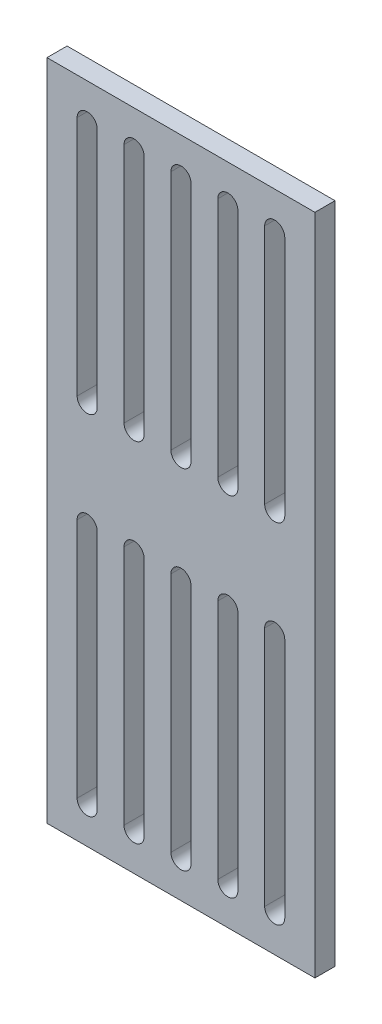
ISO-10303-21;
HEADER;
FILE_DESCRIPTION(('STEP AP214'),'2;1');
FILE_NAME('part.step','',(''),(''),'','','');
FILE_SCHEMA(('AUTOMOTIVE_DESIGN { 1 0 10303 214 1 1 1 1 }'));
ENDSEC;
DATA;
#1=APPLICATION_CONTEXT('core data for automotive mechanical design processes');
#2=APPLICATION_PROTOCOL_DEFINITION('international standard','automotive_design',2000,#1);
#3=PRODUCT_CONTEXT('',#1,'mechanical');
#4=PRODUCT('Part','Part','',(#3));
#5=PRODUCT_RELATED_PRODUCT_CATEGORY('part','',(#4));
#6=PRODUCT_DEFINITION_FORMATION('','',#4);
#7=PRODUCT_DEFINITION_CONTEXT('part definition',#1,'design');
#8=PRODUCT_DEFINITION('design','',#6,#7);
#9=PRODUCT_DEFINITION_SHAPE('','',#8);
#10=(LENGTH_UNIT() NAMED_UNIT(*) SI_UNIT(.MILLI.,.METRE.));
#11=(NAMED_UNIT(*) PLANE_ANGLE_UNIT() SI_UNIT($,.RADIAN.));
#12=(NAMED_UNIT(*) SI_UNIT($,.STERADIAN.) SOLID_ANGLE_UNIT());
#13=UNCERTAINTY_MEASURE_WITH_UNIT(LENGTH_MEASURE(1.E-05),#10,'distance_accuracy_value','');
#14=(GEOMETRIC_REPRESENTATION_CONTEXT(3) GLOBAL_UNCERTAINTY_ASSIGNED_CONTEXT((#13)) GLOBAL_UNIT_ASSIGNED_CONTEXT((#10,
#11,#12)) REPRESENTATION_CONTEXT('',''));
#15=CARTESIAN_POINT('',(0.,0.,0.));
#16=DIRECTION('',(0.,0.,1.));
#17=DIRECTION('',(1.,0.,0.));
#18=AXIS2_PLACEMENT_3D('',#15,#16,#17);
#19=CARTESIAN_POINT('',(0.,0.,19.05));
#20=DIRECTION('',(0.,0.,1.00000000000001));
#21=DIRECTION('',(1.,0.,0.));
#22=AXIS2_PLACEMENT_3D('',#19,#20,#21);
#23=PLANE('',#22);
#24=CARTESIAN_POINT('',(88.9,279.4,19.05));
#25=DIRECTION('',(0.,0.,1.00000000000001));
#26=DIRECTION('',(1.,0.,0.));
#27=AXIS2_PLACEMENT_3D('',#24,#25,#26);
#28=CIRCLE('',#27,9.525);
#29=CARTESIAN_POINT('',(98.425,279.4,19.05));
#30=VERTEX_POINT('',#29);
#31=CARTESIAN_POINT('',(79.375,279.400000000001,19.049999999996));
#32=VERTEX_POINT('',#31);
#33=EDGE_CURVE('E463',#30,#32,#28,.T.);
#34=ORIENTED_EDGE('',*,*,#33,.F.);
#35=DIRECTION('',(0.,1.,0.));
#36=VECTOR('',#35,1.);
#37=CARTESIAN_POINT('',(98.425,279.4,19.05));
#38=LINE('',#37,#36);
#39=CARTESIAN_POINT('',(98.425,50.8,19.05));
#40=VERTEX_POINT('',#39);
#41=EDGE_CURVE('E455',#40,#30,#38,.T.);
#42=ORIENTED_EDGE('',*,*,#41,.F.);
#43=CARTESIAN_POINT('',(88.9,50.8,19.05));
#44=DIRECTION('',(0.,0.,1.00000000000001));
#45=DIRECTION('',(1.,0.,0.));
#46=AXIS2_PLACEMENT_3D('',#43,#44,#45);
#47=CIRCLE('',#46,9.525);
#48=CARTESIAN_POINT('',(79.3750000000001,50.8000000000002,19.049999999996));
#49=VERTEX_POINT('',#48);
#50=EDGE_CURVE('E447',#49,#40,#47,.T.);
#51=ORIENTED_EDGE('',*,*,#50,.F.);
#52=DIRECTION('',(0.,-1.,0.));
#53=VECTOR('',#52,1.);
#54=CARTESIAN_POINT('',(79.375,279.400000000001,19.049999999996));
#55=LINE('',#54,#53);
#56=EDGE_CURVE('E435',#32,#49,#55,.T.);
#57=ORIENTED_EDGE('',*,*,#56,.F.);
#58=EDGE_LOOP('',(#34,#42,#51,#57));
#59=FACE_BOUND('',#58,.T.);
#60=CARTESIAN_POINT('',(-44.45,279.4,19.049999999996));
#61=DIRECTION('',(0.,0.,1.00000000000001));
#62=DIRECTION('',(1.,0.,0.));
#63=AXIS2_PLACEMENT_3D('',#60,#61,#62);
#64=CIRCLE('',#63,9.525);
#65=CARTESIAN_POINT('',(-34.925,279.400000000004,19.0499999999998));
#66=VERTEX_POINT('',#65);
#67=CARTESIAN_POINT('',(-53.975,279.4,19.05));
#68=VERTEX_POINT('',#67);
#69=EDGE_CURVE('E497',#66,#68,#64,.T.);
#70=ORIENTED_EDGE('',*,*,#69,.F.);
#71=DIRECTION('',(0.,1.,0.));
#72=VECTOR('',#71,1.);
#73=CARTESIAN_POINT('',(-34.925,279.400000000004,19.0499999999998));
#74=LINE('',#73,#72);
#75=CARTESIAN_POINT('',(-34.9249999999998,50.800000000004,19.0499999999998));
#76=VERTEX_POINT('',#75);
#77=EDGE_CURVE('E489',#76,#66,#74,.T.);
#78=ORIENTED_EDGE('',*,*,#77,.F.);
#79=CARTESIAN_POINT('',(-44.4499999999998,50.8,19.049999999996));
#80=DIRECTION('',(0.,0.,1.00000000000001));
#81=DIRECTION('',(1.,0.,0.));
#82=AXIS2_PLACEMENT_3D('',#79,#80,#81);
#83=CIRCLE('',#82,9.525);
#84=CARTESIAN_POINT('',(-53.9749999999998,50.8,19.05));
#85=VERTEX_POINT('',#84);
#86=EDGE_CURVE('E481',#85,#76,#83,.T.);
#87=ORIENTED_EDGE('',*,*,#86,.F.);
#88=DIRECTION('',(0.,-1.,0.));
#89=VECTOR('',#88,1.);
#90=CARTESIAN_POINT('',(-53.975,279.4,19.05));
#91=LINE('',#90,#89);
#92=EDGE_CURVE('E469',#68,#85,#91,.T.);
#93=ORIENTED_EDGE('',*,*,#92,.F.);
#94=EDGE_LOOP('',(#70,#78,#87,#93));
#95=FACE_BOUND('',#94,.T.);
#96=CARTESIAN_POINT('',(-88.9,279.4,19.049999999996));
#97=DIRECTION('',(0.,0.,1.00000000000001));
#98=DIRECTION('',(1.,0.,0.));
#99=AXIS2_PLACEMENT_3D('',#96,#97,#98);
#100=CIRCLE('',#99,9.525);
#101=CARTESIAN_POINT('',(-79.375,279.4,19.05));
#102=VERTEX_POINT('',#101);
#103=CARTESIAN_POINT('',(-98.425,279.4,19.05));
#104=VERTEX_POINT('',#103);
#105=EDGE_CURVE('E529',#102,#104,#100,.T.);
#106=ORIENTED_EDGE('',*,*,#105,.F.);
#107=DIRECTION('',(0.,1.,0.));
#108=VECTOR('',#107,1.);
#109=CARTESIAN_POINT('',(-79.375,279.4,19.05));
#110=LINE('',#109,#108);
#111=CARTESIAN_POINT('',(-79.375,50.800000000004,19.05));
#112=VERTEX_POINT('',#111);
#113=EDGE_CURVE('E521',#112,#102,#110,.T.);
#114=ORIENTED_EDGE('',*,*,#113,.F.);
#115=CARTESIAN_POINT('',(-88.9,50.8,19.049999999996));
#116=DIRECTION('',(0.,0.,1.00000000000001));
#117=DIRECTION('',(1.,0.,0.));
#118=AXIS2_PLACEMENT_3D('',#115,#116,#117);
#119=CIRCLE('',#118,9.525);
#120=CARTESIAN_POINT('',(-98.425,50.8,19.05));
#121=VERTEX_POINT('',#120);
#122=EDGE_CURVE('E513',#121,#112,#119,.T.);
#123=ORIENTED_EDGE('',*,*,#122,.F.);
#124=DIRECTION('',(0.,-1.,0.));
#125=VECTOR('',#124,1.);
#126=CARTESIAN_POINT('',(-98.425,279.4,19.05));
#127=LINE('',#126,#125);
#128=EDGE_CURVE('E501',#104,#121,#127,.T.);
#129=ORIENTED_EDGE('',*,*,#128,.F.);
#130=EDGE_LOOP('',(#106,#114,#123,#129));
#131=FACE_BOUND('',#130,.T.);
#132=CARTESIAN_POINT('',(44.45,279.4,19.05));
#133=DIRECTION('',(0.,0.,1.00000000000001));
#134=DIRECTION('',(1.,0.,0.));
#135=AXIS2_PLACEMENT_3D('',#132,#133,#134);
#136=CIRCLE('',#135,9.525);
#137=CARTESIAN_POINT('',(53.975,279.4,19.049999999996));
#138=VERTEX_POINT('',#137);
#139=CARTESIAN_POINT('',(34.925,279.4,19.0499999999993));
#140=VERTEX_POINT('',#139);
#141=EDGE_CURVE('E559',#138,#140,#136,.T.);
#142=ORIENTED_EDGE('',*,*,#141,.F.);
#143=DIRECTION('',(0.,1.,0.));
#144=VECTOR('',#143,1.);
#145=CARTESIAN_POINT('',(53.975,279.4,19.049999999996));
#146=LINE('',#145,#144);
#147=CARTESIAN_POINT('',(53.9750000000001,50.8,19.049999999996));
#148=VERTEX_POINT('',#147);
#149=EDGE_CURVE('E551',#148,#138,#146,.T.);
#150=ORIENTED_EDGE('',*,*,#149,.F.);
#151=CARTESIAN_POINT('',(44.45,50.8,19.05));
#152=DIRECTION('',(0.,0.,1.00000000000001));
#153=DIRECTION('',(1.,0.,0.));
#154=AXIS2_PLACEMENT_3D('',#151,#152,#153);
#155=CIRCLE('',#154,9.525);
#156=CARTESIAN_POINT('',(34.925,50.8,19.0499999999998));
#157=VERTEX_POINT('',#156);
#158=EDGE_CURVE('E543',#157,#148,#155,.T.);
#159=ORIENTED_EDGE('',*,*,#158,.F.);
#160=DIRECTION('',(0.,-1.,0.));
#161=VECTOR('',#160,1.);
#162=CARTESIAN_POINT('',(34.925,279.4,19.0499999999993));
#163=LINE('',#162,#161);
#164=EDGE_CURVE('E468',#140,#157,#163,.T.);
#165=ORIENTED_EDGE('',*,*,#164,.F.);
#166=EDGE_LOOP('',(#142,#150,#159,#165));
#167=FACE_BOUND('',#166,.T.);
#168=CARTESIAN_POINT('',(0.,279.4,19.05));
#169=DIRECTION('',(0.,0.,1.00000000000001));
#170=DIRECTION('',(1.,0.,0.));
#171=AXIS2_PLACEMENT_3D('',#168,#169,#170);
#172=CIRCLE('',#171,9.525);
#173=CARTESIAN_POINT('',(9.52499999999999,279.4,19.049999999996));
#174=VERTEX_POINT('',#173);
#175=CARTESIAN_POINT('',(-9.52499999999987,279.4,19.05));
#176=VERTEX_POINT('',#175);
#177=EDGE_CURVE('E603',#174,#176,#172,.T.);
#178=ORIENTED_EDGE('',*,*,#177,.F.);
#179=DIRECTION('',(0.,1.,0.));
#180=VECTOR('',#179,1.);
#181=CARTESIAN_POINT('',(9.52499999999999,279.4,19.049999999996));
#182=LINE('',#181,#180);
#183=CARTESIAN_POINT('',(9.52500000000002,50.8,19.049999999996));
#184=VERTEX_POINT('',#183);
#185=EDGE_CURVE('E618',#184,#174,#182,.T.);
#186=ORIENTED_EDGE('',*,*,#185,.F.);
#187=CARTESIAN_POINT('',(0.,50.8,19.05));
#188=DIRECTION('',(0.,0.,1.00000000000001));
#189=DIRECTION('',(1.,0.,0.));
#190=AXIS2_PLACEMENT_3D('',#187,#188,#189);
#191=CIRCLE('',#190,9.525);
#192=CARTESIAN_POINT('',(-9.52499999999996,50.8,19.05));
#193=VERTEX_POINT('',#192);
#194=EDGE_CURVE('E616',#193,#184,#191,.T.);
#195=ORIENTED_EDGE('',*,*,#194,.F.);
#196=DIRECTION('',(0.,-1.,0.));
#197=VECTOR('',#196,1.);
#198=CARTESIAN_POINT('',(-9.52499999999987,279.4,19.05));
#199=LINE('',#198,#197);
#200=EDGE_CURVE('E584',#176,#193,#199,.T.);
#201=ORIENTED_EDGE('',*,*,#200,.F.);
#202=EDGE_LOOP('',(#178,#186,#195,#201));
#203=FACE_BOUND('',#202,.T.);
#204=DIRECTION('',(0.,1.,0.));
#205=VECTOR('',#204,1.);
#206=CARTESIAN_POINT('',(127.,314.325000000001,19.05));
#207=LINE('',#206,#205);
#208=CARTESIAN_POINT('',(127.,-314.324999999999,19.05));
#209=VERTEX_POINT('',#208);
#210=CARTESIAN_POINT('',(127.,314.325000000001,19.05));
#211=VERTEX_POINT('',#210);
#212=EDGE_CURVE('E588',#209,#211,#207,.T.);
#213=ORIENTED_EDGE('',*,*,#212,.T.);
#214=DIRECTION('',(-1.,0.,0.));
#215=VECTOR('',#214,1.);
#216=CARTESIAN_POINT('',(-127.,314.325,19.049999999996));
#217=LINE('',#216,#215);
#218=CARTESIAN_POINT('',(-127.,314.325,19.049999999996));
#219=VERTEX_POINT('',#218);
#220=EDGE_CURVE('E591',#211,#219,#217,.T.);
#221=ORIENTED_EDGE('',*,*,#220,.T.);
#222=DIRECTION('',(0.,-1.,0.));
#223=VECTOR('',#222,1.);
#224=CARTESIAN_POINT('',(-127.,314.325,19.049999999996));
#225=LINE('',#224,#223);
#226=CARTESIAN_POINT('',(-127.,-314.325,19.049999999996));
#227=VERTEX_POINT('',#226);
#228=EDGE_CURVE('E594',#219,#227,#225,.T.);
#229=ORIENTED_EDGE('',*,*,#228,.T.);
#230=DIRECTION('',(1.,0.,0.));
#231=VECTOR('',#230,1.);
#232=CARTESIAN_POINT('',(-127.,-314.325,19.049999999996));
#233=LINE('',#232,#231);
#234=EDGE_CURVE('E596',#227,#209,#233,.T.);
#235=ORIENTED_EDGE('',*,*,#234,.T.);
#236=EDGE_LOOP('',(#213,#221,#229,#235));
#237=FACE_BOUND('',#236,.T.);
#238=DIRECTION('',(0.,1.,0.));
#239=VECTOR('',#238,1.);
#240=CARTESIAN_POINT('',(9.52500000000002,0.,19.049999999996));
#241=LINE('',#240,#239);
#242=CARTESIAN_POINT('',(9.52500000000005,-50.8,19.049999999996));
#243=VERTEX_POINT('',#242);
#244=CARTESIAN_POINT('',(9.52500000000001,-279.4,19.049999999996));
#245=VERTEX_POINT('',#244);
#246=EDGE_CURVE('E427',#243,#245,#241,.F.);
#247=ORIENTED_EDGE('',*,*,#246,.T.);
#248=CARTESIAN_POINT('',(0.,-279.4,19.05));
#249=DIRECTION('',(0.,0.,1.00000000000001));
#250=DIRECTION('',(1.,0.,0.));
#251=AXIS2_PLACEMENT_3D('',#248,#249,#250);
#252=CIRCLE('',#251,9.525);
#253=CARTESIAN_POINT('',(-9.52499999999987,-279.4,19.05));
#254=VERTEX_POINT('',#253);
#255=EDGE_CURVE('E504',#245,#254,#252,.F.);
#256=ORIENTED_EDGE('',*,*,#255,.T.);
#257=DIRECTION('',(0.,1.,0.));
#258=VECTOR('',#257,1.);
#259=CARTESIAN_POINT('',(-9.52499999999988,0.,19.05));
#260=LINE('',#259,#258);
#261=CARTESIAN_POINT('',(-9.52499999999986,-50.8,19.05));
#262=VERTEX_POINT('',#261);
#263=EDGE_CURVE('E627',#254,#262,#260,.T.);
#264=ORIENTED_EDGE('',*,*,#263,.T.);
#265=CARTESIAN_POINT('',(0.,-50.8,19.05));
#266=DIRECTION('',(0.,0.,1.00000000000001));
#267=DIRECTION('',(1.,0.,0.));
#268=AXIS2_PLACEMENT_3D('',#265,#266,#267);
#269=CIRCLE('',#268,9.525);
#270=EDGE_CURVE('E624',#262,#243,#269,.F.);
#271=ORIENTED_EDGE('',*,*,#270,.T.);
#272=EDGE_LOOP('',(#247,#256,#264,#271));
#273=FACE_BOUND('',#272,.T.);
#274=DIRECTION('',(0.,1.,0.));
#275=VECTOR('',#274,1.);
#276=CARTESIAN_POINT('',(98.425,0.,19.05));
#277=LINE('',#276,#275);
#278=CARTESIAN_POINT('',(98.425,-50.8,19.05));
#279=VERTEX_POINT('',#278);
#280=CARTESIAN_POINT('',(98.425,-279.4,19.05));
#281=VERTEX_POINT('',#280);
#282=EDGE_CURVE('E353',#279,#281,#277,.F.);
#283=ORIENTED_EDGE('',*,*,#282,.T.);
#284=CARTESIAN_POINT('',(88.9,-279.4,19.05));
#285=DIRECTION('',(0.,0.,1.00000000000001));
#286=DIRECTION('',(1.,0.,0.));
#287=AXIS2_PLACEMENT_3D('',#284,#285,#286);
#288=CIRCLE('',#287,9.525);
#289=CARTESIAN_POINT('',(79.375,-279.4,19.049999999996));
#290=VERTEX_POINT('',#289);
#291=EDGE_CURVE('E640',#281,#290,#288,.F.);
#292=ORIENTED_EDGE('',*,*,#291,.T.);
#293=DIRECTION('',(0.,1.,0.));
#294=VECTOR('',#293,1.);
#295=CARTESIAN_POINT('',(79.375,0.,19.049999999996));
#296=LINE('',#295,#294);
#297=CARTESIAN_POINT('',(79.375,-50.8,19.049999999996));
#298=VERTEX_POINT('',#297);
#299=EDGE_CURVE('E637',#290,#298,#296,.T.);
#300=ORIENTED_EDGE('',*,*,#299,.T.);
#301=CARTESIAN_POINT('',(88.9,-50.8,19.05));
#302=DIRECTION('',(0.,0.,1.00000000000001));
#303=DIRECTION('',(1.,0.,0.));
#304=AXIS2_PLACEMENT_3D('',#301,#302,#303);
#305=CIRCLE('',#304,9.525);
#306=EDGE_CURVE('E634',#298,#279,#305,.F.);
#307=ORIENTED_EDGE('',*,*,#306,.T.);
#308=EDGE_LOOP('',(#283,#292,#300,#307));
#309=FACE_BOUND('',#308,.T.);
#310=DIRECTION('',(0.,1.,0.));
#311=VECTOR('',#310,1.);
#312=CARTESIAN_POINT('',(53.975,0.,19.049999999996));
#313=LINE('',#312,#311);
#314=CARTESIAN_POINT('',(53.975,-50.8,19.049999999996));
#315=VERTEX_POINT('',#314);
#316=CARTESIAN_POINT('',(53.975,-279.4,19.049999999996));
#317=VERTEX_POINT('',#316);
#318=EDGE_CURVE('E643',#315,#317,#313,.F.);
#319=ORIENTED_EDGE('',*,*,#318,.T.);
#320=CARTESIAN_POINT('',(44.45,-279.4,19.05));
#321=DIRECTION('',(0.,0.,1.00000000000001));
#322=DIRECTION('',(1.,0.,0.));
#323=AXIS2_PLACEMENT_3D('',#320,#321,#322);
#324=CIRCLE('',#323,9.525);
#325=CARTESIAN_POINT('',(34.925,-279.4,19.0499999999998));
#326=VERTEX_POINT('',#325);
#327=EDGE_CURVE('E652',#317,#326,#324,.F.);
#328=ORIENTED_EDGE('',*,*,#327,.T.);
#329=DIRECTION('',(0.,1.,0.));
#330=VECTOR('',#329,1.);
#331=CARTESIAN_POINT('',(34.925,0.,19.0499999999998));
#332=LINE('',#331,#330);
#333=CARTESIAN_POINT('',(34.925,-50.8,19.0499999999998));
#334=VERTEX_POINT('',#333);
#335=EDGE_CURVE('E649',#326,#334,#332,.T.);
#336=ORIENTED_EDGE('',*,*,#335,.T.);
#337=CARTESIAN_POINT('',(44.4500000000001,-50.8,19.05));
#338=DIRECTION('',(0.,0.,1.00000000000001));
#339=DIRECTION('',(1.,0.,0.));
#340=AXIS2_PLACEMENT_3D('',#337,#338,#339);
#341=CIRCLE('',#340,9.525);
#342=EDGE_CURVE('E646',#334,#315,#341,.F.);
#343=ORIENTED_EDGE('',*,*,#342,.T.);
#344=EDGE_LOOP('',(#319,#328,#336,#343));
#345=FACE_BOUND('',#344,.T.);
#346=DIRECTION('',(0.,1.,0.));
#347=VECTOR('',#346,1.);
#348=CARTESIAN_POINT('',(-79.375,3.99680288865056E-12,19.05));
#349=LINE('',#348,#347);
#350=CARTESIAN_POINT('',(-79.3749999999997,-50.7999999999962,19.05));
#351=VERTEX_POINT('',#350);
#352=CARTESIAN_POINT('',(-79.375,-279.399999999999,19.05));
#353=VERTEX_POINT('',#352);
#354=EDGE_CURVE('E655',#351,#353,#349,.F.);
#355=ORIENTED_EDGE('',*,*,#354,.T.);
#356=CARTESIAN_POINT('',(-88.9,-279.4,19.049999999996));
#357=DIRECTION('',(0.,0.,1.00000000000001));
#358=DIRECTION('',(1.,0.,0.));
#359=AXIS2_PLACEMENT_3D('',#356,#357,#358);
#360=CIRCLE('',#359,9.525);
#361=CARTESIAN_POINT('',(-98.4249999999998,-279.4,19.05));
#362=VERTEX_POINT('',#361);
#363=EDGE_CURVE('E664',#353,#362,#360,.F.);
#364=ORIENTED_EDGE('',*,*,#363,.T.);
#365=DIRECTION('',(0.,1.,0.));
#366=VECTOR('',#365,1.);
#367=CARTESIAN_POINT('',(-98.425,0.,19.05));
#368=LINE('',#367,#366);
#369=CARTESIAN_POINT('',(-98.4249999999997,-50.8,19.05));
#370=VERTEX_POINT('',#369);
#371=EDGE_CURVE('E661',#362,#370,#368,.T.);
#372=ORIENTED_EDGE('',*,*,#371,.T.);
#373=CARTESIAN_POINT('',(-88.8999999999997,-50.8,19.049999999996));
#374=DIRECTION('',(0.,0.,1.00000000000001));
#375=DIRECTION('',(1.,0.,0.));
#376=AXIS2_PLACEMENT_3D('',#373,#374,#375);
#377=CIRCLE('',#376,9.525);
#378=EDGE_CURVE('E658',#370,#351,#377,.F.);
#379=ORIENTED_EDGE('',*,*,#378,.T.);
#380=EDGE_LOOP('',(#355,#364,#372,#379));
#381=FACE_BOUND('',#380,.T.);
#382=DIRECTION('',(0.,1.,0.));
#383=VECTOR('',#382,1.);
#384=CARTESIAN_POINT('',(-34.925,3.99680288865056E-12,19.0499999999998));
#385=LINE('',#384,#383);
#386=CARTESIAN_POINT('',(-34.925,-50.799999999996,19.0499999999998));
#387=VERTEX_POINT('',#386);
#388=CARTESIAN_POINT('',(-34.9249999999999,-279.399999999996,19.0499999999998));
#389=VERTEX_POINT('',#388);
#390=EDGE_CURVE('E667',#387,#389,#385,.F.);
#391=ORIENTED_EDGE('',*,*,#390,.T.);
#392=CARTESIAN_POINT('',(-44.4499999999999,-279.4,19.049999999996));
#393=DIRECTION('',(0.,0.,1.00000000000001));
#394=DIRECTION('',(1.,0.,0.));
#395=AXIS2_PLACEMENT_3D('',#392,#393,#394);
#396=CIRCLE('',#395,9.525);
#397=CARTESIAN_POINT('',(-53.9749999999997,-279.4,19.05));
#398=VERTEX_POINT('',#397);
#399=EDGE_CURVE('E50',#389,#398,#396,.F.);
#400=ORIENTED_EDGE('',*,*,#399,.T.);
#401=DIRECTION('',(0.,1.,0.));
#402=VECTOR('',#401,1.);
#403=CARTESIAN_POINT('',(-53.9749999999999,0.,19.05));
#404=LINE('',#403,#402);
#405=CARTESIAN_POINT('',(-53.9749999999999,-50.8,19.05));
#406=VERTEX_POINT('',#405);
#407=EDGE_CURVE('E671',#398,#406,#404,.T.);
#408=ORIENTED_EDGE('',*,*,#407,.T.);
#409=CARTESIAN_POINT('',(-44.45,-50.8,19.049999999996));
#410=DIRECTION('',(0.,0.,1.00000000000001));
#411=DIRECTION('',(1.,0.,0.));
#412=AXIS2_PLACEMENT_3D('',#409,#410,#411);
#413=CIRCLE('',#412,9.525);
#414=EDGE_CURVE('E669',#406,#387,#413,.F.);
#415=ORIENTED_EDGE('',*,*,#414,.T.);
#416=EDGE_LOOP('',(#391,#400,#408,#415));
#417=FACE_BOUND('',#416,.T.);
#418=ADVANCED_FACE('F46',(#59,#95,#131,#167,#203,#237,#273,#309,#345,#381,#417),#23,.T.);
#419=CARTESIAN_POINT('',(0.,0.,0.));
#420=DIRECTION('',(0.,0.,1.00000000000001));
#421=DIRECTION('',(1.,0.,0.));
#422=AXIS2_PLACEMENT_3D('',#419,#420,#421);
#423=PLANE('',#422);
#424=CARTESIAN_POINT('',(-88.9,-279.4,-3.99680288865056E-12));
#425=DIRECTION('',(0.,0.,-1.00000000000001));
#426=DIRECTION('',(1.,0.,0.));
#427=AXIS2_PLACEMENT_3D('',#424,#425,#426);
#428=CIRCLE('',#427,9.525);
#429=CARTESIAN_POINT('',(-79.375,-279.399999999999,0.));
#430=VERTEX_POINT('',#429);
#431=CARTESIAN_POINT('',(-98.425,-279.4,0.));
#432=VERTEX_POINT('',#431);
#433=EDGE_CURVE('E358',#430,#432,#428,.T.);
#434=ORIENTED_EDGE('',*,*,#433,.F.);
#435=DIRECTION('',(0.,-1.,0.));
#436=VECTOR('',#435,1.);
#437=CARTESIAN_POINT('',(-79.375,-279.399999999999,0.));
#438=LINE('',#437,#436);
#439=CARTESIAN_POINT('',(-79.3749999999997,-50.7999999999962,0.));
#440=VERTEX_POINT('',#439);
#441=EDGE_CURVE('E360',#440,#430,#438,.T.);
#442=ORIENTED_EDGE('',*,*,#441,.F.);
#443=CARTESIAN_POINT('',(-88.8999999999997,-50.8,-3.99680288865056E-12));
#444=DIRECTION('',(0.,0.,-1.00000000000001));
#445=DIRECTION('',(1.,0.,0.));
#446=AXIS2_PLACEMENT_3D('',#443,#444,#445);
#447=CIRCLE('',#446,9.525);
#448=CARTESIAN_POINT('',(-98.425,-50.8,0.));
#449=VERTEX_POINT('',#448);
#450=EDGE_CURVE('E363',#449,#440,#447,.T.);
#451=ORIENTED_EDGE('',*,*,#450,.F.);
#452=DIRECTION('',(0.,1.,0.));
#453=VECTOR('',#452,1.);
#454=CARTESIAN_POINT('',(-98.425,-279.4,0.));
#455=LINE('',#454,#453);
#456=EDGE_CURVE('E366',#432,#449,#455,.T.);
#457=ORIENTED_EDGE('',*,*,#456,.F.);
#458=EDGE_LOOP('',(#434,#442,#451,#457));
#459=FACE_BOUND('',#458,.T.);
#460=CARTESIAN_POINT('',(88.9,-279.4,0.));
#461=DIRECTION('',(0.,0.,-1.00000000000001));
#462=DIRECTION('',(1.,0.,0.));
#463=AXIS2_PLACEMENT_3D('',#460,#461,#462);
#464=CIRCLE('',#463,9.525);
#465=CARTESIAN_POINT('',(98.425,-279.4,0.));
#466=VERTEX_POINT('',#465);
#467=CARTESIAN_POINT('',(79.375,-279.4,-3.99680288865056E-12));
#468=VERTEX_POINT('',#467);
#469=EDGE_CURVE('E395',#466,#468,#464,.T.);
#470=ORIENTED_EDGE('',*,*,#469,.F.);
#471=DIRECTION('',(0.,-1.,0.));
#472=VECTOR('',#471,1.);
#473=CARTESIAN_POINT('',(98.425,-279.4,0.));
#474=LINE('',#473,#472);
#475=CARTESIAN_POINT('',(98.425,-50.8,0.));
#476=VERTEX_POINT('',#475);
#477=EDGE_CURVE('E397',#476,#466,#474,.T.);
#478=ORIENTED_EDGE('',*,*,#477,.F.);
#479=CARTESIAN_POINT('',(88.9,-50.8,0.));
#480=DIRECTION('',(0.,0.,-1.00000000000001));
#481=DIRECTION('',(1.,0.,0.));
#482=AXIS2_PLACEMENT_3D('',#479,#480,#481);
#483=CIRCLE('',#482,9.525);
#484=CARTESIAN_POINT('',(79.375,-50.8,-3.99680288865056E-12));
#485=VERTEX_POINT('',#484);
#486=EDGE_CURVE('E399',#485,#476,#483,.T.);
#487=ORIENTED_EDGE('',*,*,#486,.F.);
#488=DIRECTION('',(0.,1.,0.));
#489=VECTOR('',#488,1.);
#490=CARTESIAN_POINT('',(79.375,-279.4,-3.99680288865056E-12));
#491=LINE('',#490,#489);
#492=EDGE_CURVE('E402',#468,#485,#491,.T.);
#493=ORIENTED_EDGE('',*,*,#492,.F.);
#494=EDGE_LOOP('',(#470,#478,#487,#493));
#495=FACE_BOUND('',#494,.T.);
#496=DIRECTION('',(0.,1.,0.));
#497=VECTOR('',#496,1.);
#498=CARTESIAN_POINT('',(127.,314.325000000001,0.));
#499=LINE('',#498,#497);
#500=CARTESIAN_POINT('',(127.,-314.324999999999,0.));
#501=VERTEX_POINT('',#500);
#502=CARTESIAN_POINT('',(127.,314.325000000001,0.));
#503=VERTEX_POINT('',#502);
#504=EDGE_CURVE('E599',#501,#503,#499,.T.);
#505=ORIENTED_EDGE('',*,*,#504,.F.);
#506=DIRECTION('',(1.,0.,0.));
#507=VECTOR('',#506,1.);
#508=CARTESIAN_POINT('',(-127.,-314.325,-3.99680288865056E-12));
#509=LINE('',#508,#507);
#510=CARTESIAN_POINT('',(-127.,-314.325,-3.99680288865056E-12));
#511=VERTEX_POINT('',#510);
#512=EDGE_CURVE('E592',#511,#501,#509,.T.);
#513=ORIENTED_EDGE('',*,*,#512,.F.);
#514=DIRECTION('',(0.,-1.,0.));
#515=VECTOR('',#514,1.);
#516=CARTESIAN_POINT('',(-127.,314.325,-3.99680288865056E-12));
#517=LINE('',#516,#515);
#518=CARTESIAN_POINT('',(-127.,314.325,-3.99680288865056E-12));
#519=VERTEX_POINT('',#518);
#520=EDGE_CURVE('E605',#519,#511,#517,.T.);
#521=ORIENTED_EDGE('',*,*,#520,.F.);
#522=DIRECTION('',(-1.,0.,0.));
#523=VECTOR('',#522,1.);
#524=CARTESIAN_POINT('',(-127.,314.325,-3.99680288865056E-12));
#525=LINE('',#524,#523);
#526=EDGE_CURVE('E602',#503,#519,#525,.T.);
#527=ORIENTED_EDGE('',*,*,#526,.F.);
#528=EDGE_LOOP('',(#505,#513,#521,#527));
#529=FACE_BOUND('',#528,.T.);
#530=DIRECTION('',(0.,1.,0.));
#531=VECTOR('',#530,1.);
#532=CARTESIAN_POINT('',(9.52500000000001,279.4,-3.99680288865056E-12));
#533=LINE('',#532,#531);
#534=CARTESIAN_POINT('',(9.52500000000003,50.8,-3.99680288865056E-12));
#535=VERTEX_POINT('',#534);
#536=CARTESIAN_POINT('',(9.52500000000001,279.4,-3.99680288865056E-12));
#537=VERTEX_POINT('',#536);
#538=EDGE_CURVE('E573',#535,#537,#533,.T.);
#539=ORIENTED_EDGE('',*,*,#538,.T.);
#540=CARTESIAN_POINT('',(0.,279.4,0.));
#541=DIRECTION('',(0.,0.,1.00000000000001));
#542=DIRECTION('',(1.,0.,0.));
#543=AXIS2_PLACEMENT_3D('',#540,#541,#542);
#544=CIRCLE('',#543,9.525);
#545=CARTESIAN_POINT('',(-9.52499999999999,279.4,0.));
#546=VERTEX_POINT('',#545);
#547=EDGE_CURVE('E564',#537,#546,#544,.T.);
#548=ORIENTED_EDGE('',*,*,#547,.T.);
#549=DIRECTION('',(0.,-1.,0.));
#550=VECTOR('',#549,1.);
#551=CARTESIAN_POINT('',(-9.52499999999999,279.4,0.));
#552=LINE('',#551,#550);
#553=CARTESIAN_POINT('',(-9.52499999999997,50.8,0.));
#554=VERTEX_POINT('',#553);
#555=EDGE_CURVE('E567',#546,#554,#552,.T.);
#556=ORIENTED_EDGE('',*,*,#555,.T.);
#557=CARTESIAN_POINT('',(0.,50.8,0.));
#558=DIRECTION('',(0.,0.,1.00000000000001));
#559=DIRECTION('',(1.,0.,0.));
#560=AXIS2_PLACEMENT_3D('',#557,#558,#559);
#561=CIRCLE('',#560,9.525);
#562=EDGE_CURVE('E570',#554,#535,#561,.T.);
#563=ORIENTED_EDGE('',*,*,#562,.T.);
#564=EDGE_LOOP('',(#539,#548,#556,#563));
#565=FACE_BOUND('',#564,.T.);
#566=DIRECTION('',(0.,1.,0.));
#567=VECTOR('',#566,1.);
#568=CARTESIAN_POINT('',(53.975,279.4,-3.99680288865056E-12));
#569=LINE('',#568,#567);
#570=CARTESIAN_POINT('',(53.9750000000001,50.8,-3.99680288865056E-12));
#571=VERTEX_POINT('',#570);
#572=CARTESIAN_POINT('',(53.975,279.4,-3.99680288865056E-12));
#573=VERTEX_POINT('',#572);
#574=EDGE_CURVE('E556',#571,#573,#569,.T.);
#575=ORIENTED_EDGE('',*,*,#574,.T.);
#576=CARTESIAN_POINT('',(44.45,279.4,0.));
#577=DIRECTION('',(0.,0.,1.00000000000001));
#578=DIRECTION('',(1.,0.,0.));
#579=AXIS2_PLACEMENT_3D('',#576,#577,#578);
#580=CIRCLE('',#579,9.525);
#581=CARTESIAN_POINT('',(34.925,279.4,-3.99680288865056E-12));
#582=VERTEX_POINT('',#581);
#583=EDGE_CURVE('E561',#573,#582,#580,.T.);
#584=ORIENTED_EDGE('',*,*,#583,.T.);
#585=DIRECTION('',(0.,-1.,0.));
#586=VECTOR('',#585,1.);
#587=CARTESIAN_POINT('',(34.925,279.4,-3.99680288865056E-12));
#588=LINE('',#587,#586);
#589=CARTESIAN_POINT('',(34.925,50.8,-3.99680288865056E-12));
#590=VERTEX_POINT('',#589);
#591=EDGE_CURVE('E534',#582,#590,#588,.T.);
#592=ORIENTED_EDGE('',*,*,#591,.T.);
#593=CARTESIAN_POINT('',(44.45,50.8,0.));
#594=DIRECTION('',(0.,0.,1.00000000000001));
#595=DIRECTION('',(1.,0.,0.));
#596=AXIS2_PLACEMENT_3D('',#593,#594,#595);
#597=CIRCLE('',#596,9.525);
#598=EDGE_CURVE('E548',#590,#571,#597,.T.);
#599=ORIENTED_EDGE('',*,*,#598,.T.);
#600=EDGE_LOOP('',(#575,#584,#592,#599));
#601=FACE_BOUND('',#600,.T.);
#602=DIRECTION('',(0.,1.,0.));
#603=VECTOR('',#602,1.);
#604=CARTESIAN_POINT('',(-79.375,279.4,0.));
#605=LINE('',#604,#603);
#606=CARTESIAN_POINT('',(-79.375,50.800000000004,0.));
#607=VERTEX_POINT('',#606);
#608=CARTESIAN_POINT('',(-79.375,279.4,0.));
#609=VERTEX_POINT('',#608);
#610=EDGE_CURVE('E526',#607,#609,#605,.T.);
#611=ORIENTED_EDGE('',*,*,#610,.T.);
#612=CARTESIAN_POINT('',(-88.9,279.4,-3.99680288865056E-12));
#613=DIRECTION('',(0.,0.,1.00000000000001));
#614=DIRECTION('',(1.,0.,0.));
#615=AXIS2_PLACEMENT_3D('',#612,#613,#614);
#616=CIRCLE('',#615,9.525);
#617=CARTESIAN_POINT('',(-98.425,279.4,0.));
#618=VERTEX_POINT('',#617);
#619=EDGE_CURVE('E472',#609,#618,#616,.T.);
#620=ORIENTED_EDGE('',*,*,#619,.T.);
#621=DIRECTION('',(0.,-1.,0.));
#622=VECTOR('',#621,1.);
#623=CARTESIAN_POINT('',(-98.425,279.4,0.));
#624=LINE('',#623,#622);
#625=CARTESIAN_POINT('',(-98.425,50.8,0.));
#626=VERTEX_POINT('',#625);
#627=EDGE_CURVE('E503',#618,#626,#624,.T.);
#628=ORIENTED_EDGE('',*,*,#627,.T.);
#629=CARTESIAN_POINT('',(-88.9,50.8,-3.99680288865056E-12));
#630=DIRECTION('',(0.,0.,1.00000000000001));
#631=DIRECTION('',(1.,0.,0.));
#632=AXIS2_PLACEMENT_3D('',#629,#630,#631);
#633=CIRCLE('',#632,9.525);
#634=EDGE_CURVE('E518',#626,#607,#633,.T.);
#635=ORIENTED_EDGE('',*,*,#634,.T.);
#636=EDGE_LOOP('',(#611,#620,#628,#635));
#637=FACE_BOUND('',#636,.T.);
#638=DIRECTION('',(0.,1.,0.));
#639=VECTOR('',#638,1.);
#640=CARTESIAN_POINT('',(-34.925,279.400000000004,-3.99680288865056E-12));
#641=LINE('',#640,#639);
#642=CARTESIAN_POINT('',(-34.9249999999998,50.800000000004,0.));
#643=VERTEX_POINT('',#642);
#644=CARTESIAN_POINT('',(-34.925,279.400000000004,-3.99680288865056E-12));
#645=VERTEX_POINT('',#644);
#646=EDGE_CURVE('E494',#643,#645,#641,.T.);
#647=ORIENTED_EDGE('',*,*,#646,.T.);
#648=CARTESIAN_POINT('',(-44.45,279.4,-3.99680288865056E-12));
#649=DIRECTION('',(0.,0.,1.00000000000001));
#650=DIRECTION('',(1.,0.,0.));
#651=AXIS2_PLACEMENT_3D('',#648,#649,#650);
#652=CIRCLE('',#651,9.525);
#653=CARTESIAN_POINT('',(-53.975,279.4,0.));
#654=VERTEX_POINT('',#653);
#655=EDGE_CURVE('E438',#645,#654,#652,.T.);
#656=ORIENTED_EDGE('',*,*,#655,.T.);
#657=DIRECTION('',(0.,-1.,0.));
#658=VECTOR('',#657,1.);
#659=CARTESIAN_POINT('',(-53.975,279.4,0.));
#660=LINE('',#659,#658);
#661=CARTESIAN_POINT('',(-53.9749999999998,50.8,0.));
#662=VERTEX_POINT('',#661);
#663=EDGE_CURVE('E471',#654,#662,#660,.T.);
#664=ORIENTED_EDGE('',*,*,#663,.T.);
#665=CARTESIAN_POINT('',(-44.4499999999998,50.8,-3.99680288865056E-12));
#666=DIRECTION('',(0.,0.,1.00000000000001));
#667=DIRECTION('',(1.,0.,0.));
#668=AXIS2_PLACEMENT_3D('',#665,#666,#667);
#669=CIRCLE('',#668,9.525);
#670=EDGE_CURVE('E486',#662,#643,#669,.T.);
#671=ORIENTED_EDGE('',*,*,#670,.T.);
#672=EDGE_LOOP('',(#647,#656,#664,#671));
#673=FACE_BOUND('',#672,.T.);
#674=DIRECTION('',(0.,1.,0.));
#675=VECTOR('',#674,1.);
#676=CARTESIAN_POINT('',(98.425,279.4,0.));
#677=LINE('',#676,#675);
#678=CARTESIAN_POINT('',(98.425,50.8,0.));
#679=VERTEX_POINT('',#678);
#680=CARTESIAN_POINT('',(98.425,279.4,0.));
#681=VERTEX_POINT('',#680);
#682=EDGE_CURVE('E460',#679,#681,#677,.T.);
#683=ORIENTED_EDGE('',*,*,#682,.T.);
#684=CARTESIAN_POINT('',(88.9,279.4,0.));
#685=DIRECTION('',(0.,0.,1.00000000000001));
#686=DIRECTION('',(1.,0.,0.));
#687=AXIS2_PLACEMENT_3D('',#684,#685,#686);
#688=CIRCLE('',#687,9.525);
#689=CARTESIAN_POINT('',(79.375,279.400000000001,-3.99680288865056E-12));
#690=VERTEX_POINT('',#689);
#691=EDGE_CURVE('E465',#681,#690,#688,.T.);
#692=ORIENTED_EDGE('',*,*,#691,.T.);
#693=DIRECTION('',(0.,-1.,0.));
#694=VECTOR('',#693,1.);
#695=CARTESIAN_POINT('',(79.375,279.400000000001,-3.99680288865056E-12));
#696=LINE('',#695,#694);
#697=CARTESIAN_POINT('',(79.375,50.8000000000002,-3.99680288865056E-12));
#698=VERTEX_POINT('',#697);
#699=EDGE_CURVE('E437',#690,#698,#696,.T.);
#700=ORIENTED_EDGE('',*,*,#699,.T.);
#701=CARTESIAN_POINT('',(88.9,50.8,0.));
#702=DIRECTION('',(0.,0.,1.00000000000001));
#703=DIRECTION('',(1.,0.,0.));
#704=AXIS2_PLACEMENT_3D('',#701,#702,#703);
#705=CIRCLE('',#704,9.525);
#706=EDGE_CURVE('E452',#698,#679,#705,.T.);
#707=ORIENTED_EDGE('',*,*,#706,.T.);
#708=EDGE_LOOP('',(#683,#692,#700,#707));
#709=FACE_BOUND('',#708,.T.);
#710=CARTESIAN_POINT('',(0.,-279.4,0.));
#711=DIRECTION('',(0.,0.,-1.00000000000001));
#712=DIRECTION('',(1.,0.,0.));
#713=AXIS2_PLACEMENT_3D('',#710,#711,#712);
#714=CIRCLE('',#713,9.525);
#715=CARTESIAN_POINT('',(9.52499999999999,-279.4,-3.99680288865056E-12));
#716=VERTEX_POINT('',#715);
#717=CARTESIAN_POINT('',(-9.525,-279.4,0.));
#718=VERTEX_POINT('',#717);
#719=EDGE_CURVE('E414',#716,#718,#714,.T.);
#720=ORIENTED_EDGE('',*,*,#719,.F.);
#721=DIRECTION('',(0.,-1.,0.));
#722=VECTOR('',#721,1.);
#723=CARTESIAN_POINT('',(9.52499999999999,-279.4,-3.99680288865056E-12));
#724=LINE('',#723,#722);
#725=CARTESIAN_POINT('',(9.52500000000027,-50.8,-3.99680288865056E-12));
#726=VERTEX_POINT('',#725);
#727=EDGE_CURVE('E416',#726,#716,#724,.T.);
#728=ORIENTED_EDGE('',*,*,#727,.F.);
#729=CARTESIAN_POINT('',(2.77555756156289E-13,-50.8,0.));
#730=DIRECTION('',(0.,0.,-1.00000000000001));
#731=DIRECTION('',(1.,0.,0.));
#732=AXIS2_PLACEMENT_3D('',#729,#730,#731);
#733=CIRCLE('',#732,9.525);
#734=CARTESIAN_POINT('',(-9.52499999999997,-50.8,0.));
#735=VERTEX_POINT('',#734);
#736=EDGE_CURVE('E418',#735,#726,#733,.T.);
#737=ORIENTED_EDGE('',*,*,#736,.F.);
#738=DIRECTION('',(0.,1.,0.));
#739=VECTOR('',#738,1.);
#740=CARTESIAN_POINT('',(-9.525,-279.4,0.));
#741=LINE('',#740,#739);
#742=EDGE_CURVE('E421',#718,#735,#741,.T.);
#743=ORIENTED_EDGE('',*,*,#742,.F.);
#744=EDGE_LOOP('',(#720,#728,#737,#743));
#745=FACE_BOUND('',#744,.T.);
#746=CARTESIAN_POINT('',(44.45,-279.4,0.));
#747=DIRECTION('',(0.,0.,-1.00000000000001));
#748=DIRECTION('',(1.,0.,0.));
#749=AXIS2_PLACEMENT_3D('',#746,#747,#748);
#750=CIRCLE('',#749,9.525);
#751=CARTESIAN_POINT('',(53.975,-279.4,-3.99680288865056E-12));
#752=VERTEX_POINT('',#751);
#753=CARTESIAN_POINT('',(34.925,-279.4,0.));
#754=VERTEX_POINT('',#753);
#755=EDGE_CURVE('E375',#752,#754,#750,.T.);
#756=ORIENTED_EDGE('',*,*,#755,.F.);
#757=DIRECTION('',(0.,-1.,0.));
#758=VECTOR('',#757,1.);
#759=CARTESIAN_POINT('',(53.975,-279.4,-3.99680288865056E-12));
#760=LINE('',#759,#758);
#761=CARTESIAN_POINT('',(53.975,-50.8,-3.99680288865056E-12));
#762=VERTEX_POINT('',#761);
#763=EDGE_CURVE('E377',#762,#752,#760,.T.);
#764=ORIENTED_EDGE('',*,*,#763,.F.);
#765=CARTESIAN_POINT('',(44.4500000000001,-50.8,0.));
#766=DIRECTION('',(0.,0.,-1.00000000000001));
#767=DIRECTION('',(1.,0.,0.));
#768=AXIS2_PLACEMENT_3D('',#765,#766,#767);
#769=CIRCLE('',#768,9.525);
#770=CARTESIAN_POINT('',(34.9250000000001,-50.8,-3.99680288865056E-12));
#771=VERTEX_POINT('',#770);
#772=EDGE_CURVE('E380',#771,#762,#769,.T.);
#773=ORIENTED_EDGE('',*,*,#772,.F.);
#774=DIRECTION('',(0.,1.,0.));
#775=VECTOR('',#774,1.);
#776=CARTESIAN_POINT('',(34.925,-279.4,0.));
#777=LINE('',#776,#775);
#778=EDGE_CURVE('E383',#754,#771,#777,.T.);
#779=ORIENTED_EDGE('',*,*,#778,.F.);
#780=EDGE_LOOP('',(#756,#764,#773,#779));
#781=FACE_BOUND('',#780,.T.);
#782=CARTESIAN_POINT('',(-44.4499999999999,-279.4,-3.99680288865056E-12));
#783=DIRECTION('',(0.,0.,-1.00000000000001));
#784=DIRECTION('',(1.,0.,0.));
#785=AXIS2_PLACEMENT_3D('',#782,#783,#784);
#786=CIRCLE('',#785,9.525);
#787=CARTESIAN_POINT('',(-34.9249999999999,-279.399999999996,0.));
#788=VERTEX_POINT('',#787);
#789=CARTESIAN_POINT('',(-53.9749999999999,-279.4,0.));
#790=VERTEX_POINT('',#789);
#791=EDGE_CURVE('E331',#788,#790,#786,.T.);
#792=ORIENTED_EDGE('',*,*,#791,.F.);
#793=DIRECTION('',(0.,-1.,0.));
#794=VECTOR('',#793,1.);
#795=CARTESIAN_POINT('',(-34.9249999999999,-279.399999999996,0.));
#796=LINE('',#795,#794);
#797=CARTESIAN_POINT('',(-34.925,-50.799999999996,0.));
#798=VERTEX_POINT('',#797);
#799=EDGE_CURVE('E322',#798,#788,#796,.T.);
#800=ORIENTED_EDGE('',*,*,#799,.F.);
#801=CARTESIAN_POINT('',(-44.45,-50.8,-3.99680288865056E-12));
#802=DIRECTION('',(0.,0.,-1.00000000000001));
#803=DIRECTION('',(1.,0.,0.));
#804=AXIS2_PLACEMENT_3D('',#801,#802,#803);
#805=CIRCLE('',#804,9.525);
#806=CARTESIAN_POINT('',(-53.975,-50.8,0.));
#807=VERTEX_POINT('',#806);
#808=EDGE_CURVE('E330',#807,#798,#805,.T.);
#809=ORIENTED_EDGE('',*,*,#808,.F.);
#810=DIRECTION('',(0.,1.,0.));
#811=VECTOR('',#810,1.);
#812=CARTESIAN_POINT('',(-53.9749999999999,-279.4,0.));
#813=LINE('',#812,#811);
#814=EDGE_CURVE('E339',#790,#807,#813,.T.);
#815=ORIENTED_EDGE('',*,*,#814,.F.);
#816=EDGE_LOOP('',(#792,#800,#809,#815));
#817=FACE_BOUND('',#816,.T.);
#818=ADVANCED_FACE('F342',(#459,#495,#529,#565,#601,#637,#673,#709,#745,#781,#817),#423,.F.);
#819=CARTESIAN_POINT('',(127.,314.325000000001,19.05));
#820=DIRECTION('',(-1.,0.,0.));
#821=DIRECTION('',(0.,-1.,0.));
#822=AXIS2_PLACEMENT_3D('',#819,#820,#821);
#823=PLANE('',#822);
#824=ORIENTED_EDGE('',*,*,#504,.T.);
#825=DIRECTION('',(0.,0.,-1.00000000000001));
#826=VECTOR('',#825,1.);
#827=CARTESIAN_POINT('',(127.,314.325000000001,19.05));
#828=LINE('',#827,#826);
#829=EDGE_CURVE('E13',#211,#503,#828,.T.);
#830=ORIENTED_EDGE('',*,*,#829,.F.);
#831=ORIENTED_EDGE('',*,*,#212,.F.);
#832=DIRECTION('',(0.,0.,-1.00000000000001));
#833=VECTOR('',#832,1.);
#834=CARTESIAN_POINT('',(127.,-314.324999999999,19.05));
#835=LINE('',#834,#833);
#836=EDGE_CURVE('E598',#209,#501,#835,.T.);
#837=ORIENTED_EDGE('',*,*,#836,.T.);
#838=EDGE_LOOP('',(#824,#830,#831,#837));
#839=FACE_BOUND('',#838,.T.);
#840=ADVANCED_FACE('F48',(#839),#823,.F.);
#841=CARTESIAN_POINT('',(-127.,314.325,19.049999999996));
#842=DIRECTION('',(0.,-1.,0.));
#843=DIRECTION('',(0.,0.,-1.00000000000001));
#844=AXIS2_PLACEMENT_3D('',#841,#842,#843);
#845=PLANE('',#844);
#846=ORIENTED_EDGE('',*,*,#526,.T.);
#847=DIRECTION('',(0.,0.,-1.00000000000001));
#848=VECTOR('',#847,1.);
#849=CARTESIAN_POINT('',(-127.,314.325,19.049999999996));
#850=LINE('',#849,#848);
#851=EDGE_CURVE('E56',#219,#519,#850,.T.);
#852=ORIENTED_EDGE('',*,*,#851,.F.);
#853=ORIENTED_EDGE('',*,*,#220,.F.);
#854=ORIENTED_EDGE('',*,*,#829,.T.);
#855=EDGE_LOOP('',(#846,#852,#853,#854));
#856=FACE_BOUND('',#855,.T.);
#857=ADVANCED_FACE('F708',(#856),#845,.F.);
#858=CARTESIAN_POINT('',(-127.,314.325,19.049999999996));
#859=DIRECTION('',(1.,0.,0.));
#860=DIRECTION('',(0.,1.,0.));
#861=AXIS2_PLACEMENT_3D('',#858,#859,#860);
#862=PLANE('',#861);
#863=ORIENTED_EDGE('',*,*,#520,.T.);
#864=DIRECTION('',(0.,0.,-1.00000000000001));
#865=VECTOR('',#864,1.);
#866=CARTESIAN_POINT('',(-127.,-314.325,19.049999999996));
#867=LINE('',#866,#865);
#868=EDGE_CURVE('E610',#227,#511,#867,.T.);
#869=ORIENTED_EDGE('',*,*,#868,.F.);
#870=ORIENTED_EDGE('',*,*,#228,.F.);
#871=ORIENTED_EDGE('',*,*,#851,.T.);
#872=EDGE_LOOP('',(#863,#869,#870,#871));
#873=FACE_BOUND('',#872,.T.);
#874=ADVANCED_FACE('F705',(#873),#862,.F.);
#875=CARTESIAN_POINT('',(-127.,-314.325,19.049999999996));
#876=DIRECTION('',(0.,1.,0.));
#877=DIRECTION('',(0.,0.,1.00000000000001));
#878=AXIS2_PLACEMENT_3D('',#875,#876,#877);
#879=PLANE('',#878);
#880=ORIENTED_EDGE('',*,*,#512,.T.);
#881=ORIENTED_EDGE('',*,*,#836,.F.);
#882=ORIENTED_EDGE('',*,*,#234,.F.);
#883=ORIENTED_EDGE('',*,*,#868,.T.);
#884=EDGE_LOOP('',(#880,#881,#882,#883));
#885=FACE_BOUND('',#884,.T.);
#886=ADVANCED_FACE('F702',(#885),#879,.F.);
#887=CARTESIAN_POINT('',(0.,279.4,0.));
#888=DIRECTION('',(0.,0.,1.00000000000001));
#889=DIRECTION('',(1.,0.,0.));
#890=AXIS2_PLACEMENT_3D('',#887,#888,#889);
#891=CYLINDRICAL_SURFACE('',#890,9.525);
#892=ORIENTED_EDGE('',*,*,#177,.T.);
#893=DIRECTION('',(0.,0.,1.00000000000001));
#894=VECTOR('',#893,1.);
#895=CARTESIAN_POINT('',(-9.52499999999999,279.4,0.));
#896=LINE('',#895,#894);
#897=EDGE_CURVE('E576',#546,#176,#896,.T.);
#898=ORIENTED_EDGE('',*,*,#897,.F.);
#899=ORIENTED_EDGE('',*,*,#547,.F.);
#900=DIRECTION('',(0.,0.,1.00000000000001));
#901=VECTOR('',#900,1.);
#902=CARTESIAN_POINT('',(9.52500000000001,279.4,-3.99680288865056E-12));
#903=LINE('',#902,#901);
#904=EDGE_CURVE('E580',#537,#174,#903,.T.);
#905=ORIENTED_EDGE('',*,*,#904,.T.);
#906=EDGE_LOOP('',(#892,#898,#899,#905));
#907=FACE_BOUND('',#906,.T.);
#908=ADVANCED_FACE('F699',(#907),#891,.F.);
#909=CARTESIAN_POINT('',(9.52500000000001,279.4,-3.99680288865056E-12));
#910=DIRECTION('',(1.,0.,0.));
#911=DIRECTION('',(0.,1.,0.));
#912=AXIS2_PLACEMENT_3D('',#909,#910,#911);
#913=PLANE('',#912);
#914=ORIENTED_EDGE('',*,*,#185,.T.);
#915=ORIENTED_EDGE('',*,*,#904,.F.);
#916=ORIENTED_EDGE('',*,*,#538,.F.);
#917=DIRECTION('',(0.,0.,1.00000000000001));
#918=VECTOR('',#917,1.);
#919=CARTESIAN_POINT('',(9.52500000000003,50.8,-3.99680288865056E-12));
#920=LINE('',#919,#918);
#921=EDGE_CURVE('E577',#535,#184,#920,.T.);
#922=ORIENTED_EDGE('',*,*,#921,.T.);
#923=EDGE_LOOP('',(#914,#915,#916,#922));
#924=FACE_BOUND('',#923,.T.);
#925=ADVANCED_FACE('F875',(#924),#913,.F.);
#926=CARTESIAN_POINT('',(0.,50.8,0.));
#927=DIRECTION('',(0.,0.,1.00000000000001));
#928=DIRECTION('',(1.,0.,0.));
#929=AXIS2_PLACEMENT_3D('',#926,#927,#928);
#930=CYLINDRICAL_SURFACE('',#929,9.525);
#931=ORIENTED_EDGE('',*,*,#194,.T.);
#932=ORIENTED_EDGE('',*,*,#921,.F.);
#933=ORIENTED_EDGE('',*,*,#562,.F.);
#934=DIRECTION('',(0.,0.,1.00000000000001));
#935=VECTOR('',#934,1.);
#936=CARTESIAN_POINT('',(-9.52499999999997,50.8,0.));
#937=LINE('',#936,#935);
#938=EDGE_CURVE('E581',#554,#193,#937,.T.);
#939=ORIENTED_EDGE('',*,*,#938,.T.);
#940=EDGE_LOOP('',(#931,#932,#933,#939));
#941=FACE_BOUND('',#940,.T.);
#942=ADVANCED_FACE('F878',(#941),#930,.F.);
#943=CARTESIAN_POINT('',(-9.52499999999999,279.4,0.));
#944=DIRECTION('',(-1.,0.,0.));
#945=DIRECTION('',(0.,-1.,0.));
#946=AXIS2_PLACEMENT_3D('',#943,#944,#945);
#947=PLANE('',#946);
#948=ORIENTED_EDGE('',*,*,#200,.T.);
#949=ORIENTED_EDGE('',*,*,#938,.F.);
#950=ORIENTED_EDGE('',*,*,#555,.F.);
#951=ORIENTED_EDGE('',*,*,#897,.T.);
#952=EDGE_LOOP('',(#948,#949,#950,#951));
#953=FACE_BOUND('',#952,.T.);
#954=ADVANCED_FACE('F873',(#953),#947,.F.);
#955=CARTESIAN_POINT('',(44.45,279.4,0.));
#956=DIRECTION('',(0.,0.,1.00000000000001));
#957=DIRECTION('',(1.,0.,0.));
#958=AXIS2_PLACEMENT_3D('',#955,#956,#957);
#959=CYLINDRICAL_SURFACE('',#958,9.525);
#960=ORIENTED_EDGE('',*,*,#141,.T.);
#961=DIRECTION('',(0.,0.,1.00000000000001));
#962=VECTOR('',#961,1.);
#963=CARTESIAN_POINT('',(34.925,279.4,-3.99680288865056E-12));
#964=LINE('',#963,#962);
#965=EDGE_CURVE('E540',#582,#140,#964,.T.);
#966=ORIENTED_EDGE('',*,*,#965,.F.);
#967=ORIENTED_EDGE('',*,*,#583,.F.);
#968=DIRECTION('',(0.,0.,1.00000000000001));
#969=VECTOR('',#968,1.);
#970=CARTESIAN_POINT('',(53.975,279.4,-3.99680288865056E-12));
#971=LINE('',#970,#969);
#972=EDGE_CURVE('E553',#573,#138,#971,.T.);
#973=ORIENTED_EDGE('',*,*,#972,.T.);
#974=EDGE_LOOP('',(#960,#966,#967,#973));
#975=FACE_BOUND('',#974,.T.);
#976=ADVANCED_FACE('F869',(#975),#959,.F.);
#977=CARTESIAN_POINT('',(53.975,279.4,-3.99680288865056E-12));
#978=DIRECTION('',(1.,0.,0.));
#979=DIRECTION('',(0.,1.,0.));
#980=AXIS2_PLACEMENT_3D('',#977,#978,#979);
#981=PLANE('',#980);
#982=ORIENTED_EDGE('',*,*,#149,.T.);
#983=ORIENTED_EDGE('',*,*,#972,.F.);
#984=ORIENTED_EDGE('',*,*,#574,.F.);
#985=DIRECTION('',(0.,0.,1.00000000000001));
#986=VECTOR('',#985,1.);
#987=CARTESIAN_POINT('',(53.9750000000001,50.8,-3.99680288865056E-12));
#988=LINE('',#987,#986);
#989=EDGE_CURVE('E545',#571,#148,#988,.T.);
#990=ORIENTED_EDGE('',*,*,#989,.T.);
#991=EDGE_LOOP('',(#982,#983,#984,#990));
#992=FACE_BOUND('',#991,.T.);
#993=ADVANCED_FACE('F865',(#992),#981,.F.);
#994=CARTESIAN_POINT('',(44.45,50.8,0.));
#995=DIRECTION('',(0.,0.,1.00000000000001));
#996=DIRECTION('',(1.,0.,0.));
#997=AXIS2_PLACEMENT_3D('',#994,#995,#996);
#998=CYLINDRICAL_SURFACE('',#997,9.525);
#999=ORIENTED_EDGE('',*,*,#158,.T.);
#1000=ORIENTED_EDGE('',*,*,#989,.F.);
#1001=ORIENTED_EDGE('',*,*,#598,.F.);
#1002=DIRECTION('',(0.,0.,1.00000000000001));
#1003=VECTOR('',#1002,1.);
#1004=CARTESIAN_POINT('',(34.925,50.8,-3.99680288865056E-12));
#1005=LINE('',#1004,#1003);
#1006=EDGE_CURVE('E537',#590,#157,#1005,.T.);
#1007=ORIENTED_EDGE('',*,*,#1006,.T.);
#1008=EDGE_LOOP('',(#999,#1000,#1001,#1007));
#1009=FACE_BOUND('',#1008,.T.);
#1010=ADVANCED_FACE('F861',(#1009),#998,.F.);
#1011=CARTESIAN_POINT('',(34.925,279.4,-3.99680288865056E-12));
#1012=DIRECTION('',(-1.,0.,0.));
#1013=DIRECTION('',(0.,-1.,0.));
#1014=AXIS2_PLACEMENT_3D('',#1011,#1012,#1013);
#1015=PLANE('',#1014);
#1016=ORIENTED_EDGE('',*,*,#164,.T.);
#1017=ORIENTED_EDGE('',*,*,#1006,.F.);
#1018=ORIENTED_EDGE('',*,*,#591,.F.);
#1019=ORIENTED_EDGE('',*,*,#965,.T.);
#1020=EDGE_LOOP('',(#1016,#1017,#1018,#1019));
#1021=FACE_BOUND('',#1020,.T.);
#1022=ADVANCED_FACE('F857',(#1021),#1015,.F.);
#1023=CARTESIAN_POINT('',(-88.9,279.4,-3.99680288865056E-12));
#1024=DIRECTION('',(0.,0.,1.00000000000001));
#1025=DIRECTION('',(1.,0.,0.));
#1026=AXIS2_PLACEMENT_3D('',#1023,#1024,#1025);
#1027=CYLINDRICAL_SURFACE('',#1026,9.525);
#1028=ORIENTED_EDGE('',*,*,#105,.T.);
#1029=DIRECTION('',(0.,0.,1.00000000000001));
#1030=VECTOR('',#1029,1.);
#1031=CARTESIAN_POINT('',(-98.425,279.4,0.));
#1032=LINE('',#1031,#1030);
#1033=EDGE_CURVE('E510',#618,#104,#1032,.T.);
#1034=ORIENTED_EDGE('',*,*,#1033,.F.);
#1035=ORIENTED_EDGE('',*,*,#619,.F.);
#1036=DIRECTION('',(0.,0.,1.00000000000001));
#1037=VECTOR('',#1036,1.);
#1038=CARTESIAN_POINT('',(-79.375,279.4,0.));
#1039=LINE('',#1038,#1037);
#1040=EDGE_CURVE('E523',#609,#102,#1039,.T.);
#1041=ORIENTED_EDGE('',*,*,#1040,.T.);
#1042=EDGE_LOOP('',(#1028,#1034,#1035,#1041));
#1043=FACE_BOUND('',#1042,.T.);
#1044=ADVANCED_FACE('F853',(#1043),#1027,.F.);
#1045=CARTESIAN_POINT('',(-79.375,279.4,0.));
#1046=DIRECTION('',(1.,0.,0.));
#1047=DIRECTION('',(0.,1.,0.));
#1048=AXIS2_PLACEMENT_3D('',#1045,#1046,#1047);
#1049=PLANE('',#1048);
#1050=ORIENTED_EDGE('',*,*,#113,.T.);
#1051=ORIENTED_EDGE('',*,*,#1040,.F.);
#1052=ORIENTED_EDGE('',*,*,#610,.F.);
#1053=DIRECTION('',(0.,0.,1.00000000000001));
#1054=VECTOR('',#1053,1.);
#1055=CARTESIAN_POINT('',(-79.375,50.800000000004,0.));
#1056=LINE('',#1055,#1054);
#1057=EDGE_CURVE('E515',#607,#112,#1056,.T.);
#1058=ORIENTED_EDGE('',*,*,#1057,.T.);
#1059=EDGE_LOOP('',(#1050,#1051,#1052,#1058));
#1060=FACE_BOUND('',#1059,.T.);
#1061=ADVANCED_FACE('F849',(#1060),#1049,.F.);
#1062=CARTESIAN_POINT('',(-88.9,50.8,-3.99680288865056E-12));
#1063=DIRECTION('',(0.,0.,1.00000000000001));
#1064=DIRECTION('',(1.,0.,0.));
#1065=AXIS2_PLACEMENT_3D('',#1062,#1063,#1064);
#1066=CYLINDRICAL_SURFACE('',#1065,9.525);
#1067=ORIENTED_EDGE('',*,*,#122,.T.);
#1068=ORIENTED_EDGE('',*,*,#1057,.F.);
#1069=ORIENTED_EDGE('',*,*,#634,.F.);
#1070=DIRECTION('',(0.,0.,1.00000000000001));
#1071=VECTOR('',#1070,1.);
#1072=CARTESIAN_POINT('',(-98.425,50.8,0.));
#1073=LINE('',#1072,#1071);
#1074=EDGE_CURVE('E507',#626,#121,#1073,.T.);
#1075=ORIENTED_EDGE('',*,*,#1074,.T.);
#1076=EDGE_LOOP('',(#1067,#1068,#1069,#1075));
#1077=FACE_BOUND('',#1076,.T.);
#1078=ADVANCED_FACE('F845',(#1077),#1066,.F.);
#1079=CARTESIAN_POINT('',(-98.425,279.4,0.));
#1080=DIRECTION('',(-1.,0.,0.));
#1081=DIRECTION('',(0.,-1.,0.));
#1082=AXIS2_PLACEMENT_3D('',#1079,#1080,#1081);
#1083=PLANE('',#1082);
#1084=ORIENTED_EDGE('',*,*,#128,.T.);
#1085=ORIENTED_EDGE('',*,*,#1074,.F.);
#1086=ORIENTED_EDGE('',*,*,#627,.F.);
#1087=ORIENTED_EDGE('',*,*,#1033,.T.);
#1088=EDGE_LOOP('',(#1084,#1085,#1086,#1087));
#1089=FACE_BOUND('',#1088,.T.);
#1090=ADVANCED_FACE('F841',(#1089),#1083,.F.);
#1091=CARTESIAN_POINT('',(-44.45,279.4,-3.99680288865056E-12));
#1092=DIRECTION('',(0.,0.,1.00000000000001));
#1093=DIRECTION('',(1.,0.,0.));
#1094=AXIS2_PLACEMENT_3D('',#1091,#1092,#1093);
#1095=CYLINDRICAL_SURFACE('',#1094,9.525);
#1096=ORIENTED_EDGE('',*,*,#69,.T.);
#1097=DIRECTION('',(0.,0.,1.00000000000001));
#1098=VECTOR('',#1097,1.);
#1099=CARTESIAN_POINT('',(-53.975,279.4,0.));
#1100=LINE('',#1099,#1098);
#1101=EDGE_CURVE('E478',#654,#68,#1100,.T.);
#1102=ORIENTED_EDGE('',*,*,#1101,.F.);
#1103=ORIENTED_EDGE('',*,*,#655,.F.);
#1104=DIRECTION('',(0.,0.,1.00000000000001));
#1105=VECTOR('',#1104,1.);
#1106=CARTESIAN_POINT('',(-34.925,279.400000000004,-3.99680288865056E-12));
#1107=LINE('',#1106,#1105);
#1108=EDGE_CURVE('E491',#645,#66,#1107,.T.);
#1109=ORIENTED_EDGE('',*,*,#1108,.T.);
#1110=EDGE_LOOP('',(#1096,#1102,#1103,#1109));
#1111=FACE_BOUND('',#1110,.T.);
#1112=ADVANCED_FACE('F837',(#1111),#1095,.F.);
#1113=CARTESIAN_POINT('',(-34.925,279.400000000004,-3.99680288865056E-12));
#1114=DIRECTION('',(1.,0.,0.));
#1115=DIRECTION('',(0.,1.,0.));
#1116=AXIS2_PLACEMENT_3D('',#1113,#1114,#1115);
#1117=PLANE('',#1116);
#1118=ORIENTED_EDGE('',*,*,#77,.T.);
#1119=ORIENTED_EDGE('',*,*,#1108,.F.);
#1120=ORIENTED_EDGE('',*,*,#646,.F.);
#1121=DIRECTION('',(0.,0.,1.00000000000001));
#1122=VECTOR('',#1121,1.);
#1123=CARTESIAN_POINT('',(-34.9249999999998,50.800000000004,0.));
#1124=LINE('',#1123,#1122);
#1125=EDGE_CURVE('E483',#643,#76,#1124,.T.);
#1126=ORIENTED_EDGE('',*,*,#1125,.T.);
#1127=EDGE_LOOP('',(#1118,#1119,#1120,#1126));
#1128=FACE_BOUND('',#1127,.T.);
#1129=ADVANCED_FACE('F833',(#1128),#1117,.F.);
#1130=CARTESIAN_POINT('',(-44.4499999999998,50.8,-3.99680288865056E-12));
#1131=DIRECTION('',(0.,0.,1.00000000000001));
#1132=DIRECTION('',(1.,0.,0.));
#1133=AXIS2_PLACEMENT_3D('',#1130,#1131,#1132);
#1134=CYLINDRICAL_SURFACE('',#1133,9.525);
#1135=ORIENTED_EDGE('',*,*,#86,.T.);
#1136=ORIENTED_EDGE('',*,*,#1125,.F.);
#1137=ORIENTED_EDGE('',*,*,#670,.F.);
#1138=DIRECTION('',(0.,0.,1.00000000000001));
#1139=VECTOR('',#1138,1.);
#1140=CARTESIAN_POINT('',(-53.9749999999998,50.8,0.));
#1141=LINE('',#1140,#1139);
#1142=EDGE_CURVE('E475',#662,#85,#1141,.T.);
#1143=ORIENTED_EDGE('',*,*,#1142,.T.);
#1144=EDGE_LOOP('',(#1135,#1136,#1137,#1143));
#1145=FACE_BOUND('',#1144,.T.);
#1146=ADVANCED_FACE('F829',(#1145),#1134,.F.);
#1147=CARTESIAN_POINT('',(-53.975,279.4,0.));
#1148=DIRECTION('',(-1.,0.,0.));
#1149=DIRECTION('',(0.,-1.,0.));
#1150=AXIS2_PLACEMENT_3D('',#1147,#1148,#1149);
#1151=PLANE('',#1150);
#1152=ORIENTED_EDGE('',*,*,#92,.T.);
#1153=ORIENTED_EDGE('',*,*,#1142,.F.);
#1154=ORIENTED_EDGE('',*,*,#663,.F.);
#1155=ORIENTED_EDGE('',*,*,#1101,.T.);
#1156=EDGE_LOOP('',(#1152,#1153,#1154,#1155));
#1157=FACE_BOUND('',#1156,.T.);
#1158=ADVANCED_FACE('F825',(#1157),#1151,.F.);
#1159=CARTESIAN_POINT('',(88.9,279.4,0.));
#1160=DIRECTION('',(0.,0.,1.00000000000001));
#1161=DIRECTION('',(1.,0.,0.));
#1162=AXIS2_PLACEMENT_3D('',#1159,#1160,#1161);
#1163=CYLINDRICAL_SURFACE('',#1162,9.525);
#1164=ORIENTED_EDGE('',*,*,#33,.T.);
#1165=DIRECTION('',(0.,0.,1.00000000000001));
#1166=VECTOR('',#1165,1.);
#1167=CARTESIAN_POINT('',(79.375,279.400000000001,-3.99680288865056E-12));
#1168=LINE('',#1167,#1166);
#1169=EDGE_CURVE('E444',#690,#32,#1168,.T.);
#1170=ORIENTED_EDGE('',*,*,#1169,.F.);
#1171=ORIENTED_EDGE('',*,*,#691,.F.);
#1172=DIRECTION('',(0.,0.,1.00000000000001));
#1173=VECTOR('',#1172,1.);
#1174=CARTESIAN_POINT('',(98.425,279.4,0.));
#1175=LINE('',#1174,#1173);
#1176=EDGE_CURVE('E457',#681,#30,#1175,.T.);
#1177=ORIENTED_EDGE('',*,*,#1176,.T.);
#1178=EDGE_LOOP('',(#1164,#1170,#1171,#1177));
#1179=FACE_BOUND('',#1178,.T.);
#1180=ADVANCED_FACE('F821',(#1179),#1163,.F.);
#1181=CARTESIAN_POINT('',(98.425,279.4,0.));
#1182=DIRECTION('',(1.,0.,0.));
#1183=DIRECTION('',(0.,1.,0.));
#1184=AXIS2_PLACEMENT_3D('',#1181,#1182,#1183);
#1185=PLANE('',#1184);
#1186=ORIENTED_EDGE('',*,*,#41,.T.);
#1187=ORIENTED_EDGE('',*,*,#1176,.F.);
#1188=ORIENTED_EDGE('',*,*,#682,.F.);
#1189=DIRECTION('',(0.,0.,1.00000000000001));
#1190=VECTOR('',#1189,1.);
#1191=CARTESIAN_POINT('',(98.425,50.8,0.));
#1192=LINE('',#1191,#1190);
#1193=EDGE_CURVE('E449',#679,#40,#1192,.T.);
#1194=ORIENTED_EDGE('',*,*,#1193,.T.);
#1195=EDGE_LOOP('',(#1186,#1187,#1188,#1194));
#1196=FACE_BOUND('',#1195,.T.);
#1197=ADVANCED_FACE('F817',(#1196),#1185,.F.);
#1198=CARTESIAN_POINT('',(88.9,50.8,0.));
#1199=DIRECTION('',(0.,0.,1.00000000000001));
#1200=DIRECTION('',(1.,0.,0.));
#1201=AXIS2_PLACEMENT_3D('',#1198,#1199,#1200);
#1202=CYLINDRICAL_SURFACE('',#1201,9.525);
#1203=ORIENTED_EDGE('',*,*,#50,.T.);
#1204=ORIENTED_EDGE('',*,*,#1193,.F.);
#1205=ORIENTED_EDGE('',*,*,#706,.F.);
#1206=DIRECTION('',(0.,0.,1.00000000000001));
#1207=VECTOR('',#1206,1.);
#1208=CARTESIAN_POINT('',(79.375,50.8000000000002,-3.99680288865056E-12));
#1209=LINE('',#1208,#1207);
#1210=EDGE_CURVE('E441',#698,#49,#1209,.T.);
#1211=ORIENTED_EDGE('',*,*,#1210,.T.);
#1212=EDGE_LOOP('',(#1203,#1204,#1205,#1211));
#1213=FACE_BOUND('',#1212,.T.);
#1214=ADVANCED_FACE('F813',(#1213),#1202,.F.);
#1215=CARTESIAN_POINT('',(79.375,279.400000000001,-3.99680288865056E-12));
#1216=DIRECTION('',(-1.,0.,0.));
#1217=DIRECTION('',(0.,-1.,0.));
#1218=AXIS2_PLACEMENT_3D('',#1215,#1216,#1217);
#1219=PLANE('',#1218);
#1220=ORIENTED_EDGE('',*,*,#56,.T.);
#1221=ORIENTED_EDGE('',*,*,#1210,.F.);
#1222=ORIENTED_EDGE('',*,*,#699,.F.);
#1223=ORIENTED_EDGE('',*,*,#1169,.T.);
#1224=EDGE_LOOP('',(#1220,#1221,#1222,#1223));
#1225=FACE_BOUND('',#1224,.T.);
#1226=ADVANCED_FACE('F809',(#1225),#1219,.F.);
#1227=CARTESIAN_POINT('',(0.,-279.4,0.));
#1228=DIRECTION('',(0.,0.,1.00000000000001));
#1229=DIRECTION('',(1.,0.,0.));
#1230=AXIS2_PLACEMENT_3D('',#1227,#1228,#1229);
#1231=CYLINDRICAL_SURFACE('',#1230,9.525);
#1232=DIRECTION('',(0.,0.,1.00000000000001));
#1233=VECTOR('',#1232,1.);
#1234=CARTESIAN_POINT('',(9.52499999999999,-279.4,-3.99680288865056E-12));
#1235=LINE('',#1234,#1233);
#1236=EDGE_CURVE('E423',#716,#245,#1235,.T.);
#1237=ORIENTED_EDGE('',*,*,#1236,.F.);
#1238=ORIENTED_EDGE('',*,*,#719,.T.);
#1239=DIRECTION('',(0.,0.,1.00000000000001));
#1240=VECTOR('',#1239,1.);
#1241=CARTESIAN_POINT('',(-9.525,-279.4,0.));
#1242=LINE('',#1241,#1240);
#1243=EDGE_CURVE('E424',#718,#254,#1242,.T.);
#1244=ORIENTED_EDGE('',*,*,#1243,.T.);
#1245=ORIENTED_EDGE('',*,*,#255,.F.);
#1246=EDGE_LOOP('',(#1237,#1238,#1244,#1245));
#1247=FACE_BOUND('',#1246,.T.);
#1248=ADVANCED_FACE('F799',(#1247),#1231,.F.);
#1249=CARTESIAN_POINT('',(-9.525,-279.4,0.));
#1250=DIRECTION('',(1.,0.,0.));
#1251=DIRECTION('',(0.,1.,0.));
#1252=AXIS2_PLACEMENT_3D('',#1249,#1250,#1251);
#1253=PLANE('',#1252);
#1254=ORIENTED_EDGE('',*,*,#1243,.F.);
#1255=ORIENTED_EDGE('',*,*,#742,.T.);
#1256=DIRECTION('',(0.,0.,1.00000000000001));
#1257=VECTOR('',#1256,1.);
#1258=CARTESIAN_POINT('',(-9.52499999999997,-50.8,0.));
#1259=LINE('',#1258,#1257);
#1260=EDGE_CURVE('E428',#735,#262,#1259,.T.);
#1261=ORIENTED_EDGE('',*,*,#1260,.T.);
#1262=ORIENTED_EDGE('',*,*,#263,.F.);
#1263=EDGE_LOOP('',(#1254,#1255,#1261,#1262));
#1264=FACE_BOUND('',#1263,.T.);
#1265=ADVANCED_FACE('F795',(#1264),#1253,.T.);
#1266=CARTESIAN_POINT('',(2.77555756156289E-13,-50.8,0.));
#1267=DIRECTION('',(0.,0.,1.00000000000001));
#1268=DIRECTION('',(1.,0.,0.));
#1269=AXIS2_PLACEMENT_3D('',#1266,#1267,#1268);
#1270=CYLINDRICAL_SURFACE('',#1269,9.525);
#1271=ORIENTED_EDGE('',*,*,#1260,.F.);
#1272=ORIENTED_EDGE('',*,*,#736,.T.);
#1273=DIRECTION('',(0.,0.,1.00000000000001));
#1274=VECTOR('',#1273,1.);
#1275=CARTESIAN_POINT('',(9.52500000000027,-50.8,-3.99680288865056E-12));
#1276=LINE('',#1275,#1274);
#1277=EDGE_CURVE('E431',#726,#243,#1276,.T.);
#1278=ORIENTED_EDGE('',*,*,#1277,.T.);
#1279=ORIENTED_EDGE('',*,*,#270,.F.);
#1280=EDGE_LOOP('',(#1271,#1272,#1278,#1279));
#1281=FACE_BOUND('',#1280,.T.);
#1282=ADVANCED_FACE('F798',(#1281),#1270,.F.);
#1283=CARTESIAN_POINT('',(9.52499999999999,-279.4,-3.99680288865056E-12));
#1284=DIRECTION('',(-1.,0.,0.));
#1285=DIRECTION('',(0.,-1.,0.));
#1286=AXIS2_PLACEMENT_3D('',#1283,#1284,#1285);
#1287=PLANE('',#1286);
#1288=ORIENTED_EDGE('',*,*,#1277,.F.);
#1289=ORIENTED_EDGE('',*,*,#727,.T.);
#1290=ORIENTED_EDGE('',*,*,#1236,.T.);
#1291=ORIENTED_EDGE('',*,*,#246,.F.);
#1292=EDGE_LOOP('',(#1288,#1289,#1290,#1291));
#1293=FACE_BOUND('',#1292,.T.);
#1294=ADVANCED_FACE('F793',(#1293),#1287,.T.);
#1295=CARTESIAN_POINT('',(88.9,-279.4,0.));
#1296=DIRECTION('',(0.,0.,1.00000000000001));
#1297=DIRECTION('',(1.,0.,0.));
#1298=AXIS2_PLACEMENT_3D('',#1295,#1296,#1297);
#1299=CYLINDRICAL_SURFACE('',#1298,9.525);
#1300=DIRECTION('',(0.,0.,1.00000000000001));
#1301=VECTOR('',#1300,1.);
#1302=CARTESIAN_POINT('',(98.425,-279.4,0.));
#1303=LINE('',#1302,#1301);
#1304=EDGE_CURVE('E404',#466,#281,#1303,.T.);
#1305=ORIENTED_EDGE('',*,*,#1304,.F.);
#1306=ORIENTED_EDGE('',*,*,#469,.T.);
#1307=DIRECTION('',(0.,0.,1.00000000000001));
#1308=VECTOR('',#1307,1.);
#1309=CARTESIAN_POINT('',(79.375,-279.4,-3.99680288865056E-12));
#1310=LINE('',#1309,#1308);
#1311=EDGE_CURVE('E378',#468,#290,#1310,.T.);
#1312=ORIENTED_EDGE('',*,*,#1311,.T.);
#1313=ORIENTED_EDGE('',*,*,#291,.F.);
#1314=EDGE_LOOP('',(#1305,#1306,#1312,#1313));
#1315=FACE_BOUND('',#1314,.T.);
#1316=ADVANCED_FACE('F783',(#1315),#1299,.F.);
#1317=CARTESIAN_POINT('',(79.375,-279.4,-3.99680288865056E-12));
#1318=DIRECTION('',(1.,0.,0.));
#1319=DIRECTION('',(0.,1.,0.));
#1320=AXIS2_PLACEMENT_3D('',#1317,#1318,#1319);
#1321=PLANE('',#1320);
#1322=ORIENTED_EDGE('',*,*,#1311,.F.);
#1323=ORIENTED_EDGE('',*,*,#492,.T.);
#1324=DIRECTION('',(0.,0.,1.00000000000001));
#1325=VECTOR('',#1324,1.);
#1326=CARTESIAN_POINT('',(79.375,-50.8,-3.99680288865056E-12));
#1327=LINE('',#1326,#1325);
#1328=EDGE_CURVE('E407',#485,#298,#1327,.T.);
#1329=ORIENTED_EDGE('',*,*,#1328,.T.);
#1330=ORIENTED_EDGE('',*,*,#299,.F.);
#1331=EDGE_LOOP('',(#1322,#1323,#1329,#1330));
#1332=FACE_BOUND('',#1331,.T.);
#1333=ADVANCED_FACE('F779',(#1332),#1321,.T.);
#1334=CARTESIAN_POINT('',(88.9,-50.8,0.));
#1335=DIRECTION('',(0.,0.,1.00000000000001));
#1336=DIRECTION('',(1.,0.,0.));
#1337=AXIS2_PLACEMENT_3D('',#1334,#1335,#1336);
#1338=CYLINDRICAL_SURFACE('',#1337,9.525);
#1339=ORIENTED_EDGE('',*,*,#1328,.F.);
#1340=ORIENTED_EDGE('',*,*,#486,.T.);
#1341=DIRECTION('',(0.,0.,1.00000000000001));
#1342=VECTOR('',#1341,1.);
#1343=CARTESIAN_POINT('',(98.425,-50.8,0.));
#1344=LINE('',#1343,#1342);
#1345=EDGE_CURVE('E410',#476,#279,#1344,.T.);
#1346=ORIENTED_EDGE('',*,*,#1345,.T.);
#1347=ORIENTED_EDGE('',*,*,#306,.F.);
#1348=EDGE_LOOP('',(#1339,#1340,#1346,#1347));
#1349=FACE_BOUND('',#1348,.T.);
#1350=ADVANCED_FACE('F782',(#1349),#1338,.F.);
#1351=CARTESIAN_POINT('',(98.425,-279.4,0.));
#1352=DIRECTION('',(-1.,0.,0.));
#1353=DIRECTION('',(0.,-1.,0.));
#1354=AXIS2_PLACEMENT_3D('',#1351,#1352,#1353);
#1355=PLANE('',#1354);
#1356=ORIENTED_EDGE('',*,*,#1345,.F.);
#1357=ORIENTED_EDGE('',*,*,#477,.T.);
#1358=ORIENTED_EDGE('',*,*,#1304,.T.);
#1359=ORIENTED_EDGE('',*,*,#282,.F.);
#1360=EDGE_LOOP('',(#1356,#1357,#1358,#1359));
#1361=FACE_BOUND('',#1360,.T.);
#1362=ADVANCED_FACE('F777',(#1361),#1355,.T.);
#1363=CARTESIAN_POINT('',(44.45,-279.4,0.));
#1364=DIRECTION('',(0.,0.,1.00000000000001));
#1365=DIRECTION('',(1.,0.,0.));
#1366=AXIS2_PLACEMENT_3D('',#1363,#1364,#1365);
#1367=CYLINDRICAL_SURFACE('',#1366,9.525);
#1368=DIRECTION('',(0.,0.,1.00000000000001));
#1369=VECTOR('',#1368,1.);
#1370=CARTESIAN_POINT('',(53.975,-279.4,-3.99680288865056E-12));
#1371=LINE('',#1370,#1369);
#1372=EDGE_CURVE('E385',#752,#317,#1371,.T.);
#1373=ORIENTED_EDGE('',*,*,#1372,.F.);
#1374=ORIENTED_EDGE('',*,*,#755,.T.);
#1375=DIRECTION('',(0.,0.,1.00000000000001));
#1376=VECTOR('',#1375,1.);
#1377=CARTESIAN_POINT('',(34.925,-279.4,0.));
#1378=LINE('',#1377,#1376);
#1379=EDGE_CURVE('E361',#754,#326,#1378,.T.);
#1380=ORIENTED_EDGE('',*,*,#1379,.T.);
#1381=ORIENTED_EDGE('',*,*,#327,.F.);
#1382=EDGE_LOOP('',(#1373,#1374,#1380,#1381));
#1383=FACE_BOUND('',#1382,.T.);
#1384=ADVANCED_FACE('F767',(#1383),#1367,.F.);
#1385=CARTESIAN_POINT('',(34.925,-279.4,0.));
#1386=DIRECTION('',(1.,0.,0.));
#1387=DIRECTION('',(0.,1.,0.));
#1388=AXIS2_PLACEMENT_3D('',#1385,#1386,#1387);
#1389=PLANE('',#1388);
#1390=ORIENTED_EDGE('',*,*,#1379,.F.);
#1391=ORIENTED_EDGE('',*,*,#778,.T.);
#1392=DIRECTION('',(0.,0.,1.00000000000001));
#1393=VECTOR('',#1392,1.);
#1394=CARTESIAN_POINT('',(34.9250000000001,-50.8,-3.99680288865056E-12));
#1395=LINE('',#1394,#1393);
#1396=EDGE_CURVE('E388',#771,#334,#1395,.T.);
#1397=ORIENTED_EDGE('',*,*,#1396,.T.);
#1398=ORIENTED_EDGE('',*,*,#335,.F.);
#1399=EDGE_LOOP('',(#1390,#1391,#1397,#1398));
#1400=FACE_BOUND('',#1399,.T.);
#1401=ADVANCED_FACE('F763',(#1400),#1389,.T.);
#1402=CARTESIAN_POINT('',(44.4500000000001,-50.8,0.));
#1403=DIRECTION('',(0.,0.,1.00000000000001));
#1404=DIRECTION('',(1.,0.,0.));
#1405=AXIS2_PLACEMENT_3D('',#1402,#1403,#1404);
#1406=CYLINDRICAL_SURFACE('',#1405,9.525);
#1407=ORIENTED_EDGE('',*,*,#1396,.F.);
#1408=ORIENTED_EDGE('',*,*,#772,.T.);
#1409=DIRECTION('',(0.,0.,1.00000000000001));
#1410=VECTOR('',#1409,1.);
#1411=CARTESIAN_POINT('',(53.975,-50.8,-3.99680288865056E-12));
#1412=LINE('',#1411,#1410);
#1413=EDGE_CURVE('E391',#762,#315,#1412,.T.);
#1414=ORIENTED_EDGE('',*,*,#1413,.T.);
#1415=ORIENTED_EDGE('',*,*,#342,.F.);
#1416=EDGE_LOOP('',(#1407,#1408,#1414,#1415));
#1417=FACE_BOUND('',#1416,.T.);
#1418=ADVANCED_FACE('F766',(#1417),#1406,.F.);
#1419=CARTESIAN_POINT('',(53.975,-279.4,-3.99680288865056E-12));
#1420=DIRECTION('',(-1.,0.,0.));
#1421=DIRECTION('',(0.,-1.,0.));
#1422=AXIS2_PLACEMENT_3D('',#1419,#1420,#1421);
#1423=PLANE('',#1422);
#1424=ORIENTED_EDGE('',*,*,#1413,.F.);
#1425=ORIENTED_EDGE('',*,*,#763,.T.);
#1426=ORIENTED_EDGE('',*,*,#1372,.T.);
#1427=ORIENTED_EDGE('',*,*,#318,.F.);
#1428=EDGE_LOOP('',(#1424,#1425,#1426,#1427));
#1429=FACE_BOUND('',#1428,.T.);
#1430=ADVANCED_FACE('F757',(#1429),#1423,.T.);
#1431=CARTESIAN_POINT('',(-88.9,-279.4,-3.99680288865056E-12));
#1432=DIRECTION('',(0.,0.,1.00000000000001));
#1433=DIRECTION('',(1.,0.,0.));
#1434=AXIS2_PLACEMENT_3D('',#1431,#1432,#1433);
#1435=CYLINDRICAL_SURFACE('',#1434,9.525);
#1436=DIRECTION('',(0.,0.,1.00000000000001));
#1437=VECTOR('',#1436,1.);
#1438=CARTESIAN_POINT('',(-79.375,-279.399999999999,0.));
#1439=LINE('',#1438,#1437);
#1440=EDGE_CURVE('E367',#430,#353,#1439,.T.);
#1441=ORIENTED_EDGE('',*,*,#1440,.F.);
#1442=ORIENTED_EDGE('',*,*,#433,.T.);
#1443=DIRECTION('',(0.,0.,1.00000000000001));
#1444=VECTOR('',#1443,1.);
#1445=CARTESIAN_POINT('',(-98.425,-279.4,0.));
#1446=LINE('',#1445,#1444);
#1447=EDGE_CURVE('E343',#432,#362,#1446,.T.);
#1448=ORIENTED_EDGE('',*,*,#1447,.T.);
#1449=ORIENTED_EDGE('',*,*,#363,.F.);
#1450=EDGE_LOOP('',(#1441,#1442,#1448,#1449));
#1451=FACE_BOUND('',#1450,.T.);
#1452=ADVANCED_FACE('F746',(#1451),#1435,.F.);
#1453=CARTESIAN_POINT('',(-98.425,-279.4,0.));
#1454=DIRECTION('',(1.,0.,0.));
#1455=DIRECTION('',(0.,1.,0.));
#1456=AXIS2_PLACEMENT_3D('',#1453,#1454,#1455);
#1457=PLANE('',#1456);
#1458=ORIENTED_EDGE('',*,*,#1447,.F.);
#1459=ORIENTED_EDGE('',*,*,#456,.T.);
#1460=DIRECTION('',(0.,0.,1.00000000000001));
#1461=VECTOR('',#1460,1.);
#1462=CARTESIAN_POINT('',(-98.425,-50.8,0.));
#1463=LINE('',#1462,#1461);
#1464=EDGE_CURVE('E346',#449,#370,#1463,.T.);
#1465=ORIENTED_EDGE('',*,*,#1464,.T.);
#1466=ORIENTED_EDGE('',*,*,#371,.F.);
#1467=EDGE_LOOP('',(#1458,#1459,#1465,#1466));
#1468=FACE_BOUND('',#1467,.T.);
#1469=ADVANCED_FACE('F749',(#1468),#1457,.T.);
#1470=CARTESIAN_POINT('',(-88.8999999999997,-50.8,-3.99680288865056E-12));
#1471=DIRECTION('',(0.,0.,1.00000000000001));
#1472=DIRECTION('',(1.,0.,0.));
#1473=AXIS2_PLACEMENT_3D('',#1470,#1471,#1472);
#1474=CYLINDRICAL_SURFACE('',#1473,9.525);
#1475=ORIENTED_EDGE('',*,*,#1464,.F.);
#1476=ORIENTED_EDGE('',*,*,#450,.T.);
#1477=DIRECTION('',(0.,0.,1.00000000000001));
#1478=VECTOR('',#1477,1.);
#1479=CARTESIAN_POINT('',(-79.3749999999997,-50.7999999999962,0.));
#1480=LINE('',#1479,#1478);
#1481=EDGE_CURVE('E371',#440,#351,#1480,.T.);
#1482=ORIENTED_EDGE('',*,*,#1481,.T.);
#1483=ORIENTED_EDGE('',*,*,#378,.F.);
#1484=EDGE_LOOP('',(#1475,#1476,#1482,#1483));
#1485=FACE_BOUND('',#1484,.T.);
#1486=ADVANCED_FACE('F739',(#1485),#1474,.F.);
#1487=CARTESIAN_POINT('',(-79.375,-279.399999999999,0.));
#1488=DIRECTION('',(-1.,0.,0.));
#1489=DIRECTION('',(0.,-1.,0.));
#1490=AXIS2_PLACEMENT_3D('',#1487,#1488,#1489);
#1491=PLANE('',#1490);
#1492=ORIENTED_EDGE('',*,*,#1481,.F.);
#1493=ORIENTED_EDGE('',*,*,#441,.T.);
#1494=ORIENTED_EDGE('',*,*,#1440,.T.);
#1495=ORIENTED_EDGE('',*,*,#354,.F.);
#1496=EDGE_LOOP('',(#1492,#1493,#1494,#1495));
#1497=FACE_BOUND('',#1496,.T.);
#1498=ADVANCED_FACE('F735',(#1497),#1491,.T.);
#1499=CARTESIAN_POINT('',(-44.4499999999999,-279.4,-3.99680288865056E-12));
#1500=DIRECTION('',(0.,0.,1.00000000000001));
#1501=DIRECTION('',(1.,0.,0.));
#1502=AXIS2_PLACEMENT_3D('',#1499,#1500,#1501);
#1503=CYLINDRICAL_SURFACE('',#1502,9.525);
#1504=DIRECTION('',(0.,0.,1.00000000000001));
#1505=VECTOR('',#1504,1.);
#1506=CARTESIAN_POINT('',(-34.9249999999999,-279.399999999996,0.));
#1507=LINE('',#1506,#1505);
#1508=EDGE_CURVE('E64',#788,#389,#1507,.T.);
#1509=ORIENTED_EDGE('',*,*,#1508,.F.);
#1510=ORIENTED_EDGE('',*,*,#791,.T.);
#1511=DIRECTION('',(0.,0.,1.00000000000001));
#1512=VECTOR('',#1511,1.);
#1513=CARTESIAN_POINT('',(-53.9749999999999,-279.4,0.));
#1514=LINE('',#1513,#1512);
#1515=EDGE_CURVE('E351',#790,#398,#1514,.T.);
#1516=ORIENTED_EDGE('',*,*,#1515,.T.);
#1517=ORIENTED_EDGE('',*,*,#399,.F.);
#1518=EDGE_LOOP('',(#1509,#1510,#1516,#1517));
#1519=FACE_BOUND('',#1518,.T.);
#1520=ADVANCED_FACE('F334',(#1519),#1503,.F.);
#1521=CARTESIAN_POINT('',(-53.9749999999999,-279.4,0.));
#1522=DIRECTION('',(1.,0.,0.));
#1523=DIRECTION('',(0.,1.,0.));
#1524=AXIS2_PLACEMENT_3D('',#1521,#1522,#1523);
#1525=PLANE('',#1524);
#1526=ORIENTED_EDGE('',*,*,#1515,.F.);
#1527=ORIENTED_EDGE('',*,*,#814,.T.);
#1528=DIRECTION('',(0.,0.,1.00000000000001));
#1529=VECTOR('',#1528,1.);
#1530=CARTESIAN_POINT('',(-53.975,-50.8,0.));
#1531=LINE('',#1530,#1529);
#1532=EDGE_CURVE('E354',#807,#406,#1531,.T.);
#1533=ORIENTED_EDGE('',*,*,#1532,.T.);
#1534=ORIENTED_EDGE('',*,*,#407,.F.);
#1535=EDGE_LOOP('',(#1526,#1527,#1533,#1534));
#1536=FACE_BOUND('',#1535,.T.);
#1537=ADVANCED_FACE('F676',(#1536),#1525,.T.);
#1538=CARTESIAN_POINT('',(-44.45,-50.8,-3.99680288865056E-12));
#1539=DIRECTION('',(0.,0.,1.00000000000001));
#1540=DIRECTION('',(1.,0.,0.));
#1541=AXIS2_PLACEMENT_3D('',#1538,#1539,#1540);
#1542=CYLINDRICAL_SURFACE('',#1541,9.525);
#1543=ORIENTED_EDGE('',*,*,#1532,.F.);
#1544=ORIENTED_EDGE('',*,*,#808,.T.);
#1545=DIRECTION('',(0.,0.,1.00000000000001));
#1546=VECTOR('',#1545,1.);
#1547=CARTESIAN_POINT('',(-34.925,-50.799999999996,0.));
#1548=LINE('',#1547,#1546);
#1549=EDGE_CURVE('E325',#798,#387,#1548,.T.);
#1550=ORIENTED_EDGE('',*,*,#1549,.T.);
#1551=ORIENTED_EDGE('',*,*,#414,.F.);
#1552=EDGE_LOOP('',(#1543,#1544,#1550,#1551));
#1553=FACE_BOUND('',#1552,.T.);
#1554=ADVANCED_FACE('F679',(#1553),#1542,.F.);
#1555=CARTESIAN_POINT('',(-34.9249999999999,-279.399999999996,0.));
#1556=DIRECTION('',(-1.,0.,0.));
#1557=DIRECTION('',(0.,-1.,0.));
#1558=AXIS2_PLACEMENT_3D('',#1555,#1556,#1557);
#1559=PLANE('',#1558);
#1560=ORIENTED_EDGE('',*,*,#1549,.F.);
#1561=ORIENTED_EDGE('',*,*,#799,.T.);
#1562=ORIENTED_EDGE('',*,*,#1508,.T.);
#1563=ORIENTED_EDGE('',*,*,#390,.F.);
#1564=EDGE_LOOP('',(#1560,#1561,#1562,#1563));
#1565=FACE_BOUND('',#1564,.T.);
#1566=ADVANCED_FACE('F323',(#1565),#1559,.T.);
#1567=CLOSED_SHELL('',(#418,#818,#840,#857,#874,#886,#908,#925,#942,#954,#976,#993,#1010,#1022,
#1044,#1061,#1078,#1090,#1112,#1129,#1146,#1158,#1180,#1197,#1214,#1226,#1248,#1265,#1282,#1294,
#1316,#1333,#1350,#1362,#1384,#1401,#1418,#1430,#1452,#1469,#1486,#1498,#1520,#1537,#1554,#1566));
#1568=MANIFOLD_SOLID_BREP('B2',#1567);
#1569=ADVANCED_BREP_SHAPE_REPRESENTATION('',(#18,#1568),#14);
#1570=SHAPE_DEFINITION_REPRESENTATION(#9,#1569);
ENDSEC;
END-ISO-10303-21;
